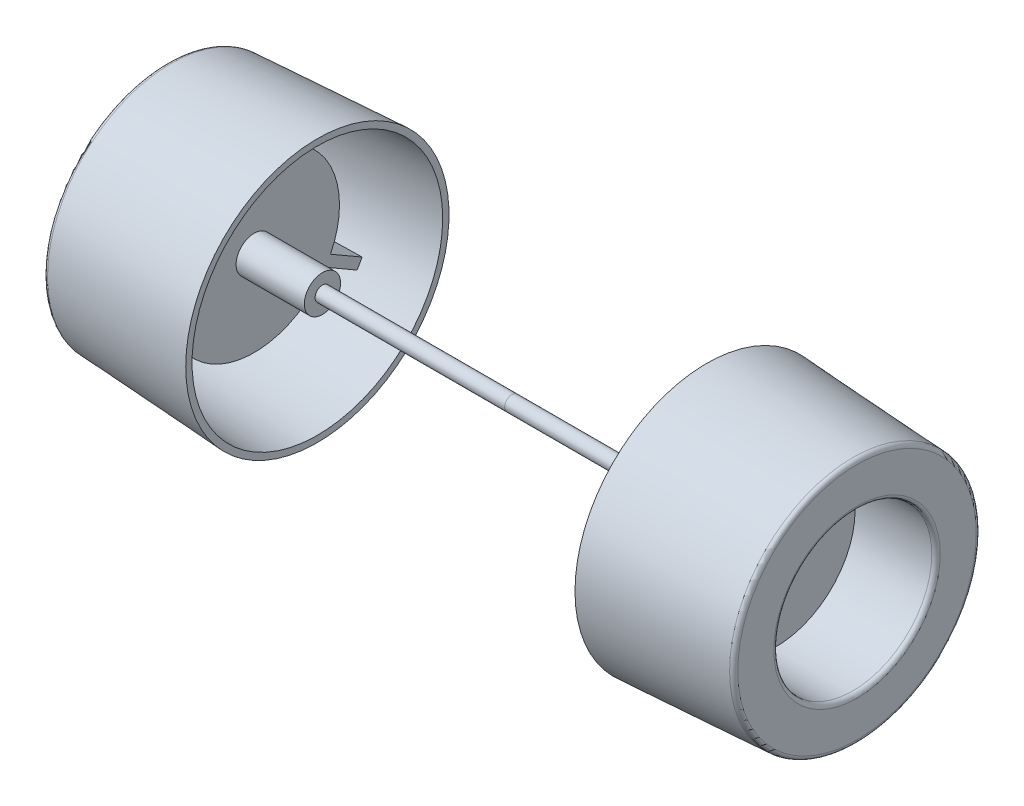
ISO-10303-21;
HEADER;
FILE_DESCRIPTION(('STEP AP214'),'2;1');
FILE_NAME('part.step','',(''),(''),'','','');
FILE_SCHEMA(('AUTOMOTIVE_DESIGN { 1 0 10303 214 1 1 1 1 }'));
ENDSEC;
DATA;
#1=APPLICATION_CONTEXT('core data for automotive mechanical design processes');
#2=APPLICATION_PROTOCOL_DEFINITION('international standard','automotive_design',2000,#1);
#3=PRODUCT_CONTEXT('',#1,'mechanical');
#4=PRODUCT('Part','Part','',(#3));
#5=PRODUCT_RELATED_PRODUCT_CATEGORY('part','',(#4));
#6=PRODUCT_DEFINITION_FORMATION('','',#4);
#7=PRODUCT_DEFINITION_CONTEXT('part definition',#1,'design');
#8=PRODUCT_DEFINITION('design','',#6,#7);
#9=PRODUCT_DEFINITION_SHAPE('','',#8);
#10=(LENGTH_UNIT() NAMED_UNIT(*) SI_UNIT(.MILLI.,.METRE.));
#11=(NAMED_UNIT(*) PLANE_ANGLE_UNIT() SI_UNIT($,.RADIAN.));
#12=(NAMED_UNIT(*) SI_UNIT($,.STERADIAN.) SOLID_ANGLE_UNIT());
#13=UNCERTAINTY_MEASURE_WITH_UNIT(LENGTH_MEASURE(1.E-05),#10,'distance_accuracy_value','');
#14=(GEOMETRIC_REPRESENTATION_CONTEXT(3) GLOBAL_UNCERTAINTY_ASSIGNED_CONTEXT((#13)) GLOBAL_UNIT_ASSIGNED_CONTEXT((#10,
#11,#12)) REPRESENTATION_CONTEXT('',''));
#15=CARTESIAN_POINT('',(0.,0.,0.));
#16=DIRECTION('',(0.,0.,1.));
#17=DIRECTION('',(1.,0.,0.));
#18=AXIS2_PLACEMENT_3D('',#15,#16,#17);
#19=CARTESIAN_POINT('',(-143.1,0.,0.));
#20=DIRECTION('',(-1.,0.,0.));
#21=DIRECTION('',(0.,0.,-1.));
#22=AXIS2_PLACEMENT_3D('',#19,#20,#21);
#23=PLANE('',#22);
#24=CARTESIAN_POINT('',(-143.1,0.,0.));
#25=DIRECTION('',(1.,0.,0.));
#26=DIRECTION('',(0.,0.,-1.));
#27=AXIS2_PLACEMENT_3D('',#24,#25,#26);
#28=CIRCLE('',#27,20.25);
#29=CARTESIAN_POINT('',(-143.1,20.2142743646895,1.20233602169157));
#30=VERTEX_POINT('',#29);
#31=CARTESIAN_POINT('',(-143.1,-9.06588364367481,18.1072431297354));
#32=VERTEX_POINT('',#31);
#33=EDGE_CURVE('E150',#30,#32,#28,.T.);
#34=ORIENTED_EDGE('',*,*,#33,.T.);
#35=DIRECTION('',(0.,0.500000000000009,-0.866025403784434));
#36=VECTOR('',#35,1.);
#37=CARTESIAN_POINT('',(-143.1,-9.06588364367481,18.1072431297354));
#38=LINE('',#37,#36);
#39=CARTESIAN_POINT('',(-143.1,-13.3998948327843,25.6139707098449));
#40=VERTEX_POINT('',#39);
#41=EDGE_CURVE('E399',#40,#32,#38,.T.);
#42=ORIENTED_EDGE('',*,*,#41,.F.);
#43=CARTESIAN_POINT('',(-143.1,0.,0.));
#44=DIRECTION('',(-1.,0.,0.));
#45=DIRECTION('',(0.,0.,1.));
#46=AXIS2_PLACEMENT_3D('',#43,#44,#45);
#47=CIRCLE('',#46,28.9073118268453);
#48=CARTESIAN_POINT('',(-143.1,-15.482401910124,24.4116346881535));
#49=VERTEX_POINT('',#48);
#50=EDGE_CURVE('E226',#40,#49,#47,.F.);
#51=ORIENTED_EDGE('',*,*,#50,.T.);
#52=DIRECTION('',(0.,-0.499999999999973,0.866025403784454));
#53=VECTOR('',#52,1.);
#54=CARTESIAN_POINT('',(-143.1,-11.1483907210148,16.9049071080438));
#55=LINE('',#54,#53);
#56=CARTESIAN_POINT('',(-143.1,-11.1483907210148,16.9049071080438));
#57=VERTEX_POINT('',#56);
#58=EDGE_CURVE('E311',#57,#49,#55,.T.);
#59=ORIENTED_EDGE('',*,*,#58,.F.);
#60=CARTESIAN_POINT('',(-143.1,-11.1483907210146,-16.904907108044));
#61=VERTEX_POINT('',#60);
#62=EDGE_CURVE('E147',#57,#61,#28,.T.);
#63=ORIENTED_EDGE('',*,*,#62,.T.);
#64=DIRECTION('',(0.,0.500000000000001,0.866025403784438));
#65=VECTOR('',#64,1.);
#66=CARTESIAN_POINT('',(-143.1,-11.1483907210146,-16.904907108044));
#67=LINE('',#66,#65);
#68=CARTESIAN_POINT('',(-143.1,-15.482401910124,-24.4116346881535));
#69=VERTEX_POINT('',#68);
#70=EDGE_CURVE('E155',#69,#61,#67,.T.);
#71=ORIENTED_EDGE('',*,*,#70,.F.);
#72=CARTESIAN_POINT('',(-143.1,0.,0.));
#73=DIRECTION('',(-1.,0.,0.));
#74=DIRECTION('',(0.,0.,1.));
#75=AXIS2_PLACEMENT_3D('',#72,#73,#74);
#76=CIRCLE('',#75,28.9073118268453);
#77=CARTESIAN_POINT('',(-143.1,-13.3998948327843,-25.6139707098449));
#78=VERTEX_POINT('',#77);
#79=EDGE_CURVE('E154',#69,#78,#76,.F.);
#80=ORIENTED_EDGE('',*,*,#79,.T.);
#81=DIRECTION('',(0.,-0.500000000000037,-0.866025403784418));
#82=VECTOR('',#81,1.);
#83=CARTESIAN_POINT('',(-143.1,-9.06588364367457,-18.1072431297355));
#84=LINE('',#83,#82);
#85=CARTESIAN_POINT('',(-143.1,-9.06588364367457,-18.1072431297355));
#86=VERTEX_POINT('',#85);
#87=EDGE_CURVE('E130',#86,#78,#84,.T.);
#88=ORIENTED_EDGE('',*,*,#87,.F.);
#89=CARTESIAN_POINT('',(-143.1,20.2142743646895,-1.20233602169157));
#90=VERTEX_POINT('',#89);
#91=EDGE_CURVE('E138',#86,#90,#28,.T.);
#92=ORIENTED_EDGE('',*,*,#91,.T.);
#93=DIRECTION('',(0.,-1.,0.));
#94=VECTOR('',#93,1.);
#95=CARTESIAN_POINT('',(-143.1,20.2142743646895,-1.20233602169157));
#96=LINE('',#95,#94);
#97=CARTESIAN_POINT('',(-143.1,28.8822967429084,-1.20233602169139));
#98=VERTEX_POINT('',#97);
#99=EDGE_CURVE('E389',#98,#90,#96,.T.);
#100=ORIENTED_EDGE('',*,*,#99,.F.);
#101=CARTESIAN_POINT('',(-143.1,0.,0.));
#102=DIRECTION('',(-1.,0.,0.));
#103=DIRECTION('',(0.,0.,1.));
#104=AXIS2_PLACEMENT_3D('',#101,#102,#103);
#105=CIRCLE('',#104,28.9073118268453);
#106=CARTESIAN_POINT('',(-143.1,28.8822967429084,1.20233602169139));
#107=VERTEX_POINT('',#106);
#108=EDGE_CURVE('E375',#98,#107,#105,.F.);
#109=ORIENTED_EDGE('',*,*,#108,.T.);
#110=DIRECTION('',(0.,1.,0.));
#111=VECTOR('',#110,1.);
#112=CARTESIAN_POINT('',(-143.1,20.2142743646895,1.20233602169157));
#113=LINE('',#112,#111);
#114=EDGE_CURVE('E391',#30,#107,#113,.T.);
#115=ORIENTED_EDGE('',*,*,#114,.F.);
#116=EDGE_LOOP('',(#34,#42,#51,#59,#63,#71,#80,#88,#92,#100,#109,#115));
#117=FACE_BOUND('',#116,.T.);
#118=CARTESIAN_POINT('',(-143.1,0.,0.));
#119=DIRECTION('',(1.,0.,0.));
#120=DIRECTION('',(0.,0.,-1.));
#121=AXIS2_PLACEMENT_3D('',#118,#119,#120);
#122=CIRCLE('',#121,4.3);
#123=CARTESIAN_POINT('',(-143.1,0.,-4.3));
#124=VERTEX_POINT('',#123);
#125=EDGE_CURVE('E421',#124,#124,#122,.F.);
#126=ORIENTED_EDGE('',*,*,#125,.T.);
#127=EDGE_LOOP('',(#126));
#128=FACE_BOUND('',#127,.T.);
#129=ADVANCED_FACE('F37',(#117,#128),#23,.F.);
#130=CARTESIAN_POINT('',(-163.716097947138,0.,0.));
#131=DIRECTION('',(1.,0.,0.));
#132=DIRECTION('',(0.,0.,1.));
#133=AXIS2_PLACEMENT_3D('',#130,#131,#132);
#134=CONICAL_SURFACE('',#133,27.7523483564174,0.0559639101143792);
#135=CARTESIAN_POINT('',(-151.1,0.,0.));
#136=DIRECTION('',(-1.,0.,0.));
#137=DIRECTION('',(0.,0.,1.));
#138=AXIS2_PLACEMENT_3D('',#135,#136,#137);
#139=CIRCLE('',#138,28.4591325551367);
#140=CARTESIAN_POINT('',(-151.1,-13.1756080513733,25.225494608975));
#141=VERTEX_POINT('',#140);
#142=CARTESIAN_POINT('',(-151.1,-15.2581151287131,24.0231585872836));
#143=VERTEX_POINT('',#142);
#144=EDGE_CURVE('E392',#141,#143,#139,.F.);
#145=ORIENTED_EDGE('',*,*,#144,.T.);
#146=CARTESIAN_POINT('',(-143.0998,-15.4824075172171,24.4116443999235));
#147=CARTESIAN_POINT('',(-144.433200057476,-15.4450250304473,24.346896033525));
#148=CARTESIAN_POINT('',(-145.766600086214,-15.4076422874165,24.2821472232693));
#149=CARTESIAN_POINT('',(-148.433400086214,-15.3328762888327,24.1526487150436));
#150=CARTESIAN_POINT('',(-149.766800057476,-15.2954930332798,24.0878990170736));
#151=CARTESIAN_POINT('',(-151.1002,-15.2581095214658,24.0231488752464));
#152=B_SPLINE_CURVE_WITH_KNOTS('',3,(#146,#147,#148,#149,#150,#151),.UNSPECIFIED.,.F.,.F.,(4,2,
4),(0.,4.00648344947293,8.01296689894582),.UNSPECIFIED.);
#153=EDGE_CURVE('E213',#49,#143,#152,.T.);
#154=ORIENTED_EDGE('',*,*,#153,.F.);
#155=ORIENTED_EDGE('',*,*,#50,.F.);
#156=CARTESIAN_POINT('',(-151.1002,-13.1756024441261,25.2254848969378));
#157=CARTESIAN_POINT('',(-149.766800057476,-13.2129859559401,25.290235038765));
#158=CARTESIAN_POINT('',(-148.433400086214,-13.250369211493,25.354984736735));
#159=CARTESIAN_POINT('',(-145.766600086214,-13.3251352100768,25.4844832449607));
#160=CARTESIAN_POINT('',(-144.433200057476,-13.3625179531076,25.5492320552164));
#161=CARTESIAN_POINT('',(-143.0998,-13.3999004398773,25.6139804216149));
#162=B_SPLINE_CURVE_WITH_KNOTS('',3,(#156,#157,#158,#159,#160,#161),.UNSPECIFIED.,.F.,.F.,(4,2,
4),(0.,4.0064834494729,8.01296689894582),.UNSPECIFIED.);
#163=EDGE_CURVE('E220',#141,#40,#162,.T.);
#164=ORIENTED_EDGE('',*,*,#163,.F.);
#165=EDGE_LOOP('',(#145,#154,#155,#164));
#166=FACE_BOUND('',#165,.T.);
#167=CARTESIAN_POINT('',(-162.3,0.,0.));
#168=DIRECTION('',(1.,0.,0.));
#169=DIRECTION('',(0.,0.,-1.));
#170=AXIS2_PLACEMENT_3D('',#167,#168,#169);
#171=CIRCLE('',#170,27.8316815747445);
#172=CARTESIAN_POINT('',(-162.3,0.,-27.8316815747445));
#173=VERTEX_POINT('',#172);
#174=EDGE_CURVE('E313',#173,#173,#171,.T.);
#175=ORIENTED_EDGE('',*,*,#174,.F.);
#176=EDGE_LOOP('',(#175));
#177=FACE_BOUND('',#176,.T.);
#178=CARTESIAN_POINT('',(-128.1,0.,0.));
#179=DIRECTION('',(1.,0.,0.));
#180=DIRECTION('',(0.,0.,-1.));
#181=AXIS2_PLACEMENT_3D('',#178,#179,#180);
#182=CIRCLE('',#181,29.7476479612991);
#183=CARTESIAN_POINT('',(-128.1,0.,-29.7476479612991));
#184=VERTEX_POINT('',#183);
#185=EDGE_CURVE('E317',#184,#184,#182,.T.);
#186=ORIENTED_EDGE('',*,*,#185,.T.);
#187=EDGE_LOOP('',(#186));
#188=FACE_BOUND('',#187,.T.);
#189=CARTESIAN_POINT('',(-151.1,0.,0.));
#190=DIRECTION('',(-1.,0.,0.));
#191=DIRECTION('',(0.,0.,1.));
#192=AXIS2_PLACEMENT_3D('',#189,#190,#191);
#193=CIRCLE('',#192,28.4591325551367);
#194=CARTESIAN_POINT('',(-151.1,28.4337231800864,-1.2023360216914));
#195=VERTEX_POINT('',#194);
#196=CARTESIAN_POINT('',(-151.1,28.4337231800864,1.2023360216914));
#197=VERTEX_POINT('',#196);
#198=EDGE_CURVE('E372',#195,#197,#193,.F.);
#199=ORIENTED_EDGE('',*,*,#198,.T.);
#200=CARTESIAN_POINT('',(-120.988941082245,30.1220402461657,1.20233602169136));
#201=CARTESIAN_POINT('',(-128.698059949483,29.6898143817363,1.20233602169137));
#202=CARTESIAN_POINT('',(-136.407177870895,29.2575716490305,1.20233602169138));
#203=CARTESIAN_POINT('',(-151.825411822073,28.393052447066,1.2023360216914));
#204=CARTESIAN_POINT('',(-159.534527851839,27.9607759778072,1.20233602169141));
#205=CARTESIAN_POINT('',(-167.24364293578,27.5284826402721,1.20233602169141));
#206=B_SPLINE_CURVE_WITH_KNOTS('',3,(#200,#201,#202,#203,#204,#205),.UNSPECIFIED.,.F.,.F.,(4,2,
4),(0.,23.1636783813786,46.3273567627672),.UNSPECIFIED.);
#207=EDGE_CURVE('E197',#107,#197,#206,.T.);
#208=ORIENTED_EDGE('',*,*,#207,.F.);
#209=ORIENTED_EDGE('',*,*,#108,.F.);
#210=CARTESIAN_POINT('',(-167.24364293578,27.5284826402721,-1.20233602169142));
#211=CARTESIAN_POINT('',(-159.534527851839,27.9607759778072,-1.20233602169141));
#212=CARTESIAN_POINT('',(-151.825411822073,28.393052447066,-1.2023360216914));
#213=CARTESIAN_POINT('',(-136.407177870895,29.2575716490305,-1.20233602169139));
#214=CARTESIAN_POINT('',(-128.698059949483,29.6898143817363,-1.20233602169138));
#215=CARTESIAN_POINT('',(-120.988941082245,30.1220402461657,-1.20233602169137));
#216=B_SPLINE_CURVE_WITH_KNOTS('',3,(#210,#211,#212,#213,#214,#215),.UNSPECIFIED.,.F.,.F.,(4,2,
4),(0.,23.1636783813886,46.3273567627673),.UNSPECIFIED.);
#217=EDGE_CURVE('E205',#195,#98,#216,.T.);
#218=ORIENTED_EDGE('',*,*,#217,.F.);
#219=EDGE_LOOP('',(#199,#208,#209,#218));
#220=FACE_BOUND('',#219,.T.);
#221=CARTESIAN_POINT('',(-151.1,0.,0.));
#222=DIRECTION('',(-1.,0.,0.));
#223=DIRECTION('',(0.,0.,1.));
#224=AXIS2_PLACEMENT_3D('',#221,#222,#223);
#225=CIRCLE('',#224,28.4591325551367);
#226=CARTESIAN_POINT('',(-151.1,-15.2581151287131,-24.0231585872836));
#227=VERTEX_POINT('',#226);
#228=CARTESIAN_POINT('',(-151.1,-13.1756080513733,-25.225494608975));
#229=VERTEX_POINT('',#228);
#230=EDGE_CURVE('E306',#227,#229,#225,.F.);
#231=ORIENTED_EDGE('',*,*,#230,.T.);
#232=CARTESIAN_POINT('',(-143.0998,-13.3999004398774,-25.6139804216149));
#233=CARTESIAN_POINT('',(-144.433200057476,-13.3625179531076,-25.5492320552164));
#234=CARTESIAN_POINT('',(-145.766600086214,-13.3251352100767,-25.4844832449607));
#235=CARTESIAN_POINT('',(-148.433400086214,-13.250369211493,-25.354984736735));
#236=CARTESIAN_POINT('',(-149.766800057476,-13.21298595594,-25.290235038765));
#237=CARTESIAN_POINT('',(-151.1002,-13.1756024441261,-25.2254848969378));
#238=B_SPLINE_CURVE_WITH_KNOTS('',3,(#232,#233,#234,#235,#236,#237),.UNSPECIFIED.,.F.,.F.,(4,2,
4),(0.,4.00648344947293,8.01296689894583),.UNSPECIFIED.);
#239=EDGE_CURVE('E53',#78,#229,#238,.T.);
#240=ORIENTED_EDGE('',*,*,#239,.F.);
#241=ORIENTED_EDGE('',*,*,#79,.F.);
#242=CARTESIAN_POINT('',(-151.1002,-15.2581095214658,-24.0231488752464));
#243=CARTESIAN_POINT('',(-149.766800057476,-15.2954930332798,-24.0878990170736));
#244=CARTESIAN_POINT('',(-148.433400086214,-15.3328762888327,-24.1526487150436));
#245=CARTESIAN_POINT('',(-145.766600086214,-15.4076422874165,-24.2821472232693));
#246=CARTESIAN_POINT('',(-144.433200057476,-15.4450250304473,-24.346896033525));
#247=CARTESIAN_POINT('',(-143.0998,-15.4824075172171,-24.4116443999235));
#248=B_SPLINE_CURVE_WITH_KNOTS('',3,(#242,#243,#244,#245,#246,#247),.UNSPECIFIED.,.F.,.F.,(4,2,
4),(0.,4.0064834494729,8.01296689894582),.UNSPECIFIED.);
#249=EDGE_CURVE('E176',#227,#69,#248,.T.);
#250=ORIENTED_EDGE('',*,*,#249,.F.);
#251=EDGE_LOOP('',(#231,#240,#241,#250));
#252=FACE_BOUND('',#251,.T.);
#253=ADVANCED_FACE('F184',(#166,#177,#188,#220,#252),#134,.F.);
#254=CARTESIAN_POINT('',(-163.8,0.,0.));
#255=DIRECTION('',(-1.,0.,0.));
#256=DIRECTION('',(0.,0.,-1.));
#257=AXIS2_PLACEMENT_3D('',#254,#255,#256);
#258=PLANE('',#257);
#259=CARTESIAN_POINT('',(-163.8,0.,0.));
#260=DIRECTION('',(1.,0.,0.));
#261=DIRECTION('',(0.,0.,-1.));
#262=AXIS2_PLACEMENT_3D('',#259,#260,#261);
#263=CIRCLE('',#262,19.75);
#264=CARTESIAN_POINT('',(-163.8,0.,-19.75));
#265=VERTEX_POINT('',#264);
#266=EDGE_CURVE('E46',#265,#265,#263,.F.);
#267=ORIENTED_EDGE('',*,*,#266,.F.);
#268=EDGE_LOOP('',(#267));
#269=FACE_BOUND('',#268,.T.);
#270=CARTESIAN_POINT('',(-163.8,0.,0.));
#271=DIRECTION('',(1.,0.,0.));
#272=DIRECTION('',(0.,0.,-1.));
#273=AXIS2_PLACEMENT_3D('',#270,#271,#272);
#274=CIRCLE('',#273,28.304454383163);
#275=CARTESIAN_POINT('',(-163.8,0.,-28.304454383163));
#276=VERTEX_POINT('',#275);
#277=EDGE_CURVE('E433',#276,#276,#274,.T.);
#278=ORIENTED_EDGE('',*,*,#277,.F.);
#279=EDGE_LOOP('',(#278));
#280=FACE_BOUND('',#279,.T.);
#281=ADVANCED_FACE('F189',(#269,#280),#258,.T.);
#282=CARTESIAN_POINT('',(-128.1,0.,0.));
#283=DIRECTION('',(-1.,0.,0.));
#284=DIRECTION('',(0.,0.,-1.));
#285=AXIS2_PLACEMENT_3D('',#282,#283,#284);
#286=PLANE('',#285);
#287=ORIENTED_EDGE('',*,*,#185,.F.);
#288=EDGE_LOOP('',(#287));
#289=FACE_BOUND('',#288,.T.);
#290=CARTESIAN_POINT('',(-128.1,0.,0.));
#291=DIRECTION('',(1.,0.,0.));
#292=DIRECTION('',(0.,0.,-1.));
#293=AXIS2_PLACEMENT_3D('',#290,#291,#292);
#294=CIRCLE('',#293,31.25);
#295=CARTESIAN_POINT('',(-128.1,0.,31.25));
#296=VERTEX_POINT('',#295);
#297=EDGE_CURVE('E323',#296,#296,#294,.T.);
#298=ORIENTED_EDGE('',*,*,#297,.T.);
#299=EDGE_LOOP('',(#298));
#300=FACE_BOUND('',#299,.T.);
#301=ADVANCED_FACE('F39',(#289,#300),#286,.F.);
#302=CARTESIAN_POINT('',(-163.8,0.,0.));
#303=DIRECTION('',(1.,0.,0.));
#304=DIRECTION('',(0.,0.,1.));
#305=AXIS2_PLACEMENT_3D('',#302,#303,#304);
#306=CONICAL_SURFACE('',#305,29.25,0.0559639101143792);
#307=CARTESIAN_POINT('',(-162.855934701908,0.,0.));
#308=DIRECTION('',(1.,0.,0.));
#309=DIRECTION('',(0.,0.,-1.));
#310=AXIS2_PLACEMENT_3D('',#307,#308,#309);
#311=CIRCLE('',#310,29.3028888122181);
#312=CARTESIAN_POINT('',(-162.855934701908,0.,29.3028888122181));
#313=VERTEX_POINT('',#312);
#314=EDGE_CURVE('E13',#313,#313,#311,.F.);
#315=CARTESIAN_POINT('',(-162.855934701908,0.,29.3028888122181));
#316=CARTESIAN_POINT('',(-162.49389371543,0.,29.3231712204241));
#317=CARTESIAN_POINT('',(-162.131852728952,0.,29.3434536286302));
#318=CARTESIAN_POINT('',(-161.407770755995,0.,29.3840184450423));
#319=CARTESIAN_POINT('',(-161.045729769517,0.,29.4043008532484));
#320=CARTESIAN_POINT('',(-160.32164779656,0.,29.4448656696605));
#321=CARTESIAN_POINT('',(-159.959606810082,0.,29.4651480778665));
#322=CARTESIAN_POINT('',(-159.235524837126,0.,29.5057128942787));
#323=CARTESIAN_POINT('',(-158.873483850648,0.,29.5259953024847));
#324=CARTESIAN_POINT('',(-158.149401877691,0.,29.5665601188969));
#325=CARTESIAN_POINT('',(-157.787360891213,0.,29.5868425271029));
#326=CARTESIAN_POINT('',(-157.063278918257,0.,29.627407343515));
#327=CARTESIAN_POINT('',(-156.701237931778,0.,29.6476897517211));
#328=CARTESIAN_POINT('',(-155.977155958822,0.,29.6882545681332));
#329=CARTESIAN_POINT('',(-155.615114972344,0.,29.7085369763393));
#330=CARTESIAN_POINT('',(-154.891032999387,0.,29.7491017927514));
#331=CARTESIAN_POINT('',(-154.528992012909,0.,29.7693842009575));
#332=CARTESIAN_POINT('',(-153.804910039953,0.,29.8099490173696));
#333=CARTESIAN_POINT('',(-153.442869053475,0.,29.8302314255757));
#334=CARTESIAN_POINT('',(-152.718787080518,0.,29.8707962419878));
#335=CARTESIAN_POINT('',(-152.35674609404,0.,29.8910786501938));
#336=CARTESIAN_POINT('',(-151.632664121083,0.,29.931643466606));
#337=CARTESIAN_POINT('',(-151.270623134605,0.,29.951925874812));
#338=CARTESIAN_POINT('',(-150.546541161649,0.,29.9924906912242));
#339=CARTESIAN_POINT('',(-150.184500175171,0.,30.0127730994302));
#340=CARTESIAN_POINT('',(-149.460418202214,0.,30.0533379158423));
#341=CARTESIAN_POINT('',(-149.098377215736,0.,30.0736203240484));
#342=CARTESIAN_POINT('',(-148.37429524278,0.,30.1141851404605));
#343=CARTESIAN_POINT('',(-148.012254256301,0.,30.1344675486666));
#344=CARTESIAN_POINT('',(-147.288172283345,0.,30.1750323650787));
#345=CARTESIAN_POINT('',(-146.926131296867,0.,30.1953147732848));
#346=CARTESIAN_POINT('',(-146.20204932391,0.,30.2358795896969));
#347=CARTESIAN_POINT('',(-145.840008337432,0.,30.256161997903));
#348=CARTESIAN_POINT('',(-145.115926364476,0.,30.2967268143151));
#349=CARTESIAN_POINT('',(-144.753885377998,0.,30.3170092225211));
#350=CARTESIAN_POINT('',(-144.029803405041,0.,30.3575740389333));
#351=CARTESIAN_POINT('',(-143.667762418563,0.,30.3778564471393));
#352=CARTESIAN_POINT('',(-142.943680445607,0.,30.4184212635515));
#353=CARTESIAN_POINT('',(-142.581639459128,0.,30.4387036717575));
#354=CARTESIAN_POINT('',(-141.857557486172,0.,30.4792684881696));
#355=CARTESIAN_POINT('',(-141.495516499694,0.,30.4995508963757));
#356=CARTESIAN_POINT('',(-140.771434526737,0.,30.5401157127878));
#357=CARTESIAN_POINT('',(-140.409393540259,0.,30.5603981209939));
#358=CARTESIAN_POINT('',(-139.685311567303,0.,30.600962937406));
#359=CARTESIAN_POINT('',(-139.323270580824,0.,30.6212453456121));
#360=CARTESIAN_POINT('',(-138.599188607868,0.,30.6618101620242));
#361=CARTESIAN_POINT('',(-138.23714762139,0.,30.6820925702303));
#362=CARTESIAN_POINT('',(-137.513065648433,0.,30.7226573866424));
#363=CARTESIAN_POINT('',(-137.151024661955,0.,30.7429397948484));
#364=CARTESIAN_POINT('',(-136.426942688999,0.,30.7835046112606));
#365=CARTESIAN_POINT('',(-136.064901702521,0.,30.8037870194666));
#366=CARTESIAN_POINT('',(-135.340819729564,0.,30.8443518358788));
#367=CARTESIAN_POINT('',(-134.978778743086,0.,30.8646342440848));
#368=CARTESIAN_POINT('',(-134.25469677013,0.,30.9051990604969));
#369=CARTESIAN_POINT('',(-133.892655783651,0.,30.925481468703));
#370=CARTESIAN_POINT('',(-133.168573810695,0.,30.9660462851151));
#371=CARTESIAN_POINT('',(-132.806532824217,0.,30.9863286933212));
#372=CARTESIAN_POINT('',(-132.08245085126,0.,31.0268935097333));
#373=CARTESIAN_POINT('',(-131.720409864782,0.,31.0471759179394));
#374=CARTESIAN_POINT('',(-130.996327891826,0.,31.0877407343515));
#375=CARTESIAN_POINT('',(-130.634286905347,0.,31.1080231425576));
#376=CARTESIAN_POINT('',(-129.910204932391,0.,31.1485879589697));
#377=CARTESIAN_POINT('',(-129.548163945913,0.,31.1688703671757));
#378=CARTESIAN_POINT('',(-128.824081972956,0.,31.2094351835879));
#379=CARTESIAN_POINT('',(-128.462040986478,0.,31.2297175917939));
#380=CARTESIAN_POINT('',(-128.1,0.,31.25));
#381=B_SPLINE_CURVE_WITH_KNOTS('',3,(#315,#316,#317,#318,#319,#320,#321,#322,#323,#324,#325,
#326,#327,#328,#329,#330,#331,#332,#333,#334,#335,#336,#337,#338,#339,#340,#341,#342,#343,#344,
#345,#346,#347,#348,#349,#350,#351,#352,#353,#354,#355,#356,#357,#358,#359,#360,#361,#362,#363,
#364,#365,#366,#367,#368,#369,#370,#371,#372,#373,#374,#375,#376,#377,#378,#379,#380),
.UNSPECIFIED.,.F.,.F.,(4,2,2,2,2,2,2,2,2,2,2,2,2,2,2,2,2,2,2,2,2,2,2,2,2,2,2,2,2,2,2,2,4),(0.,
1.08782602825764,2.17565205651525,3.26347808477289,4.35130411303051,5.43913014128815,
6.52695616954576,7.61478219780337,8.70260822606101,9.79043425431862,10.8782602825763,
11.9660863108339,13.0539123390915,14.1417383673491,15.2295643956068,16.3173904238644,
17.405216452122,18.4930424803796,19.5808685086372,20.6686945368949,21.7565205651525,
22.8443465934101,23.9321726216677,25.0199986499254,26.107824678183,27.1956507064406,
28.2834767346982,29.3713027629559,30.4591287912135,31.5469548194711,32.6347808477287,
33.7226068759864,34.810432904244),.UNSPECIFIED.);
#382=EDGE_CURVE('BSEAM332',#313,#296,#381,.T.);
#383=ORIENTED_EDGE('',*,*,#314,.F.);
#384=ORIENTED_EDGE('',*,*,#297,.F.);
#385=ORIENTED_EDGE('',*,*,#382,.T.);
#386=ORIENTED_EDGE('',*,*,#382,.F.);
#387=EDGE_LOOP('',(#383,#385,#384,#386));
#388=FACE_BOUND('',#387,.T.);
#389=ADVANCED_FACE('F332',(#388),#306,.T.);
#390=CARTESIAN_POINT('',(-144.6,0.,0.));
#391=DIRECTION('',(-1.,0.,0.));
#392=DIRECTION('',(0.,0.,-1.));
#393=AXIS2_PLACEMENT_3D('',#390,#391,#392);
#394=CYLINDRICAL_SURFACE('',#393,18.75);
#395=CARTESIAN_POINT('',(-162.8,0.,0.));
#396=DIRECTION('',(1.,0.,0.));
#397=DIRECTION('',(0.,0.,-1.));
#398=AXIS2_PLACEMENT_3D('',#395,#396,#397);
#399=CIRCLE('',#398,18.75);
#400=CARTESIAN_POINT('',(-162.8,0.,-18.75));
#401=VERTEX_POINT('',#400);
#402=EDGE_CURVE('E424',#401,#401,#399,.T.);
#403=ORIENTED_EDGE('',*,*,#402,.F.);
#404=EDGE_LOOP('',(#403));
#405=FACE_BOUND('',#404,.T.);
#406=CARTESIAN_POINT('',(-144.6,0.,0.));
#407=DIRECTION('',(1.,0.,0.));
#408=DIRECTION('',(0.,0.,-1.));
#409=AXIS2_PLACEMENT_3D('',#406,#407,#408);
#410=CIRCLE('',#409,18.75);
#411=CARTESIAN_POINT('',(-144.6,0.,-18.75));
#412=VERTEX_POINT('',#411);
#413=EDGE_CURVE('E320',#412,#412,#410,.T.);
#414=ORIENTED_EDGE('',*,*,#413,.T.);
#415=EDGE_LOOP('',(#414));
#416=FACE_BOUND('',#415,.T.);
#417=ADVANCED_FACE('F341',(#405,#416),#394,.F.);
#418=CARTESIAN_POINT('',(-144.6,0.,0.));
#419=DIRECTION('',(-1.,0.,0.));
#420=DIRECTION('',(0.,0.,-1.));
#421=AXIS2_PLACEMENT_3D('',#418,#419,#420);
#422=PLANE('',#421);
#423=ORIENTED_EDGE('',*,*,#413,.F.);
#424=EDGE_LOOP('',(#423));
#425=FACE_BOUND('',#424,.T.);
#426=ADVANCED_FACE('F347',(#425),#422,.T.);
#427=CARTESIAN_POINT('',(-162.3,0.,0.));
#428=DIRECTION('',(-1.,0.,0.));
#429=DIRECTION('',(0.,0.,-1.));
#430=AXIS2_PLACEMENT_3D('',#427,#428,#429);
#431=PLANE('',#430);
#432=CARTESIAN_POINT('',(-162.3,0.,0.));
#433=DIRECTION('',(1.,0.,0.));
#434=DIRECTION('',(0.,0.,-1.));
#435=AXIS2_PLACEMENT_3D('',#432,#433,#434);
#436=CIRCLE('',#435,20.25);
#437=CARTESIAN_POINT('',(-162.3,0.,-20.25));
#438=VERTEX_POINT('',#437);
#439=EDGE_CURVE('E148',#438,#438,#436,.T.);
#440=ORIENTED_EDGE('',*,*,#439,.F.);
#441=EDGE_LOOP('',(#440));
#442=FACE_BOUND('',#441,.T.);
#443=ORIENTED_EDGE('',*,*,#174,.T.);
#444=EDGE_LOOP('',(#443));
#445=FACE_BOUND('',#444,.T.);
#446=ADVANCED_FACE('F191',(#442,#445),#431,.F.);
#447=CARTESIAN_POINT('',(-144.6,0.,0.));
#448=DIRECTION('',(-1.,0.,0.));
#449=DIRECTION('',(0.,0.,-1.));
#450=AXIS2_PLACEMENT_3D('',#447,#448,#449);
#451=CYLINDRICAL_SURFACE('',#450,20.25);
#452=DIRECTION('',(1.,0.,0.));
#453=VECTOR('',#452,1.);
#454=CARTESIAN_POINT('',(-151.1,-11.1483907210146,-16.904907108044));
#455=LINE('',#454,#453);
#456=CARTESIAN_POINT('',(-151.1,-11.1483907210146,-16.904907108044));
#457=VERTEX_POINT('',#456);
#458=EDGE_CURVE('E134',#457,#61,#455,.T.);
#459=ORIENTED_EDGE('',*,*,#458,.T.);
#460=ORIENTED_EDGE('',*,*,#62,.F.);
#461=DIRECTION('',(1.,0.,0.));
#462=VECTOR('',#461,1.);
#463=CARTESIAN_POINT('',(-151.1,-11.1483907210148,16.9049071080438));
#464=LINE('',#463,#462);
#465=CARTESIAN_POINT('',(-151.1,-11.1483907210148,16.9049071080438));
#466=VERTEX_POINT('',#465);
#467=EDGE_CURVE('E402',#466,#57,#464,.T.);
#468=ORIENTED_EDGE('',*,*,#467,.F.);
#469=CARTESIAN_POINT('',(-151.1,0.,0.));
#470=DIRECTION('',(1.,0.,0.));
#471=DIRECTION('',(0.,0.,1.));
#472=AXIS2_PLACEMENT_3D('',#469,#470,#471);
#473=CIRCLE('',#472,20.25);
#474=CARTESIAN_POINT('',(-151.1,-9.06588364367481,18.1072431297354));
#475=VERTEX_POINT('',#474);
#476=EDGE_CURVE('E404',#475,#466,#473,.T.);
#477=ORIENTED_EDGE('',*,*,#476,.F.);
#478=DIRECTION('',(1.,0.,0.));
#479=VECTOR('',#478,1.);
#480=CARTESIAN_POINT('',(-151.1,-9.06588364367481,18.1072431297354));
#481=LINE('',#480,#479);
#482=EDGE_CURVE('E401',#475,#32,#481,.T.);
#483=ORIENTED_EDGE('',*,*,#482,.T.);
#484=ORIENTED_EDGE('',*,*,#33,.F.);
#485=DIRECTION('',(1.,0.,0.));
#486=VECTOR('',#485,1.);
#487=CARTESIAN_POINT('',(-151.1,20.2142743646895,1.20233602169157));
#488=LINE('',#487,#486);
#489=CARTESIAN_POINT('',(-151.1,20.2142743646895,1.20233602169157));
#490=VERTEX_POINT('',#489);
#491=EDGE_CURVE('E379',#490,#30,#488,.T.);
#492=ORIENTED_EDGE('',*,*,#491,.F.);
#493=CARTESIAN_POINT('',(-151.1,0.,0.));
#494=DIRECTION('',(1.,0.,0.));
#495=DIRECTION('',(0.,0.,1.));
#496=AXIS2_PLACEMENT_3D('',#493,#494,#495);
#497=CIRCLE('',#496,20.25);
#498=CARTESIAN_POINT('',(-151.1,20.2142743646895,-1.20233602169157));
#499=VERTEX_POINT('',#498);
#500=EDGE_CURVE('E386',#499,#490,#497,.T.);
#501=ORIENTED_EDGE('',*,*,#500,.F.);
#502=DIRECTION('',(1.,0.,0.));
#503=VECTOR('',#502,1.);
#504=CARTESIAN_POINT('',(-151.1,20.2142743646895,-1.20233602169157));
#505=LINE('',#504,#503);
#506=EDGE_CURVE('E143',#499,#90,#505,.T.);
#507=ORIENTED_EDGE('',*,*,#506,.T.);
#508=ORIENTED_EDGE('',*,*,#91,.F.);
#509=DIRECTION('',(1.,0.,0.));
#510=VECTOR('',#509,1.);
#511=CARTESIAN_POINT('',(-151.1,-9.06588364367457,-18.1072431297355));
#512=LINE('',#511,#510);
#513=CARTESIAN_POINT('',(-151.1,-9.06588364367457,-18.1072431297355));
#514=VERTEX_POINT('',#513);
#515=EDGE_CURVE('E126',#514,#86,#512,.T.);
#516=ORIENTED_EDGE('',*,*,#515,.F.);
#517=CARTESIAN_POINT('',(-151.1,0.,0.));
#518=DIRECTION('',(1.,0.,0.));
#519=DIRECTION('',(0.,0.,1.));
#520=AXIS2_PLACEMENT_3D('',#517,#518,#519);
#521=CIRCLE('',#520,20.25);
#522=EDGE_CURVE('E159',#457,#514,#521,.T.);
#523=ORIENTED_EDGE('',*,*,#522,.F.);
#524=EDGE_LOOP('',(#459,#460,#468,#477,#483,#484,#492,#501,#507,#508,#516,#523));
#525=FACE_BOUND('',#524,.T.);
#526=ORIENTED_EDGE('',*,*,#439,.T.);
#527=EDGE_LOOP('',(#526));
#528=FACE_BOUND('',#527,.T.);
#529=ADVANCED_FACE('F139',(#525,#528),#451,.T.);
#530=CARTESIAN_POINT('',(-151.1,0.,0.));
#531=DIRECTION('',(1.,0.,0.));
#532=DIRECTION('',(0.,0.,1.));
#533=AXIS2_PLACEMENT_3D('',#530,#531,#532);
#534=PLANE('',#533);
#535=DIRECTION('',(0.,-1.,0.));
#536=VECTOR('',#535,1.);
#537=CARTESIAN_POINT('',(-151.1,20.2142743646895,-1.20233602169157));
#538=LINE('',#537,#536);
#539=EDGE_CURVE('E381',#195,#499,#538,.T.);
#540=ORIENTED_EDGE('',*,*,#539,.T.);
#541=ORIENTED_EDGE('',*,*,#500,.T.);
#542=DIRECTION('',(0.,1.,0.));
#543=VECTOR('',#542,1.);
#544=CARTESIAN_POINT('',(-151.1,20.2142743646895,1.20233602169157));
#545=LINE('',#544,#543);
#546=EDGE_CURVE('E384',#490,#197,#545,.T.);
#547=ORIENTED_EDGE('',*,*,#546,.T.);
#548=ORIENTED_EDGE('',*,*,#198,.F.);
#549=EDGE_LOOP('',(#540,#541,#547,#548));
#550=FACE_BOUND('',#549,.T.);
#551=ADVANCED_FACE('F239',(#550),#534,.F.);
#552=CARTESIAN_POINT('',(-151.1,20.2142743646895,-1.20233602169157));
#553=DIRECTION('',(0.,0.,-1.));
#554=DIRECTION('',(0.,1.,0.));
#555=AXIS2_PLACEMENT_3D('',#552,#553,#554);
#556=PLANE('',#555);
#557=ORIENTED_EDGE('',*,*,#217,.T.);
#558=ORIENTED_EDGE('',*,*,#99,.T.);
#559=ORIENTED_EDGE('',*,*,#506,.F.);
#560=ORIENTED_EDGE('',*,*,#539,.F.);
#561=EDGE_LOOP('',(#557,#558,#559,#560));
#562=FACE_BOUND('',#561,.T.);
#563=ADVANCED_FACE('F241',(#562),#556,.T.);
#564=CARTESIAN_POINT('',(-151.1,20.2142743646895,1.20233602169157));
#565=DIRECTION('',(0.,0.,1.));
#566=DIRECTION('',(0.,-1.,0.));
#567=AXIS2_PLACEMENT_3D('',#564,#565,#566);
#568=PLANE('',#567);
#569=ORIENTED_EDGE('',*,*,#207,.T.);
#570=ORIENTED_EDGE('',*,*,#546,.F.);
#571=ORIENTED_EDGE('',*,*,#491,.T.);
#572=ORIENTED_EDGE('',*,*,#114,.T.);
#573=EDGE_LOOP('',(#569,#570,#571,#572));
#574=FACE_BOUND('',#573,.T.);
#575=ADVANCED_FACE('F245',(#574),#568,.T.);
#576=CARTESIAN_POINT('',(-151.1,0.,0.));
#577=DIRECTION('',(1.,0.,0.));
#578=DIRECTION('',(0.,0.,1.));
#579=AXIS2_PLACEMENT_3D('',#576,#577,#578);
#580=PLANE('',#579);
#581=DIRECTION('',(0.,0.500000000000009,-0.866025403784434));
#582=VECTOR('',#581,1.);
#583=CARTESIAN_POINT('',(-151.1,-9.06588364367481,18.1072431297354));
#584=LINE('',#583,#582);
#585=EDGE_CURVE('E412',#141,#475,#584,.T.);
#586=ORIENTED_EDGE('',*,*,#585,.T.);
#587=ORIENTED_EDGE('',*,*,#476,.T.);
#588=DIRECTION('',(0.,-0.499999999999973,0.866025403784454));
#589=VECTOR('',#588,1.);
#590=CARTESIAN_POINT('',(-151.1,-11.1483907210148,16.9049071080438));
#591=LINE('',#590,#589);
#592=EDGE_CURVE('E410',#466,#143,#591,.T.);
#593=ORIENTED_EDGE('',*,*,#592,.T.);
#594=ORIENTED_EDGE('',*,*,#144,.F.);
#595=EDGE_LOOP('',(#586,#587,#593,#594));
#596=FACE_BOUND('',#595,.T.);
#597=ADVANCED_FACE('F232',(#596),#580,.F.);
#598=CARTESIAN_POINT('',(-151.1,-9.06588364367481,18.1072431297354));
#599=DIRECTION('',(0.,0.866025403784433,0.500000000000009));
#600=DIRECTION('',(0.,-0.500000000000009,0.866025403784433));
#601=AXIS2_PLACEMENT_3D('',#598,#599,#600);
#602=PLANE('',#601);
#603=ORIENTED_EDGE('',*,*,#163,.T.);
#604=ORIENTED_EDGE('',*,*,#41,.T.);
#605=ORIENTED_EDGE('',*,*,#482,.F.);
#606=ORIENTED_EDGE('',*,*,#585,.F.);
#607=EDGE_LOOP('',(#603,#604,#605,#606));
#608=FACE_BOUND('',#607,.T.);
#609=ADVANCED_FACE('F228',(#608),#602,.T.);
#610=CARTESIAN_POINT('',(-151.1,-11.1483907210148,16.9049071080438));
#611=DIRECTION('',(0.,-0.866025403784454,-0.499999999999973));
#612=DIRECTION('',(0.,0.499999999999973,-0.866025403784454));
#613=AXIS2_PLACEMENT_3D('',#610,#611,#612);
#614=PLANE('',#613);
#615=ORIENTED_EDGE('',*,*,#153,.T.);
#616=ORIENTED_EDGE('',*,*,#592,.F.);
#617=ORIENTED_EDGE('',*,*,#467,.T.);
#618=ORIENTED_EDGE('',*,*,#58,.T.);
#619=EDGE_LOOP('',(#615,#616,#617,#618));
#620=FACE_BOUND('',#619,.T.);
#621=ADVANCED_FACE('F231',(#620),#614,.T.);
#622=CARTESIAN_POINT('',(-151.1,0.,0.));
#623=DIRECTION('',(1.,0.,0.));
#624=DIRECTION('',(0.,0.,1.));
#625=AXIS2_PLACEMENT_3D('',#622,#623,#624);
#626=PLANE('',#625);
#627=DIRECTION('',(0.,0.500000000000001,0.866025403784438));
#628=VECTOR('',#627,1.);
#629=CARTESIAN_POINT('',(-151.1,-11.1483907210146,-16.904907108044));
#630=LINE('',#629,#628);
#631=EDGE_CURVE('E135',#227,#457,#630,.T.);
#632=ORIENTED_EDGE('',*,*,#631,.T.);
#633=ORIENTED_EDGE('',*,*,#522,.T.);
#634=DIRECTION('',(0.,-0.500000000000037,-0.866025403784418));
#635=VECTOR('',#634,1.);
#636=CARTESIAN_POINT('',(-151.1,-9.06588364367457,-18.1072431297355));
#637=LINE('',#636,#635);
#638=EDGE_CURVE('E60',#514,#229,#637,.T.);
#639=ORIENTED_EDGE('',*,*,#638,.T.);
#640=ORIENTED_EDGE('',*,*,#230,.F.);
#641=EDGE_LOOP('',(#632,#633,#639,#640));
#642=FACE_BOUND('',#641,.T.);
#643=ADVANCED_FACE('F237',(#642),#626,.F.);
#644=CARTESIAN_POINT('',(-151.1,-11.1483907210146,-16.904907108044));
#645=DIRECTION('',(0.,-0.866025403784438,0.500000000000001));
#646=DIRECTION('',(0.,-0.500000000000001,-0.866025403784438));
#647=AXIS2_PLACEMENT_3D('',#644,#645,#646);
#648=PLANE('',#647);
#649=ORIENTED_EDGE('',*,*,#249,.T.);
#650=ORIENTED_EDGE('',*,*,#70,.T.);
#651=ORIENTED_EDGE('',*,*,#458,.F.);
#652=ORIENTED_EDGE('',*,*,#631,.F.);
#653=EDGE_LOOP('',(#649,#650,#651,#652));
#654=FACE_BOUND('',#653,.T.);
#655=ADVANCED_FACE('F292',(#654),#648,.T.);
#656=CARTESIAN_POINT('',(-151.1,-9.06588364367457,-18.1072431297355));
#657=DIRECTION('',(0.,0.866025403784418,-0.500000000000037));
#658=DIRECTION('',(0.,0.500000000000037,0.866025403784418));
#659=AXIS2_PLACEMENT_3D('',#656,#657,#658);
#660=PLANE('',#659);
#661=ORIENTED_EDGE('',*,*,#239,.T.);
#662=ORIENTED_EDGE('',*,*,#638,.F.);
#663=ORIENTED_EDGE('',*,*,#515,.T.);
#664=ORIENTED_EDGE('',*,*,#87,.T.);
#665=EDGE_LOOP('',(#661,#662,#663,#664));
#666=FACE_BOUND('',#665,.T.);
#667=ADVANCED_FACE('F128',(#666),#660,.T.);
#668=CARTESIAN_POINT('',(-126.9,0.,0.));
#669=DIRECTION('',(1.,0.,0.));
#670=DIRECTION('',(0.,0.,1.));
#671=AXIS2_PLACEMENT_3D('',#668,#669,#670);
#672=PLANE('',#671);
#673=CARTESIAN_POINT('',(-126.9,0.,0.));
#674=DIRECTION('',(-1.,0.,0.));
#675=DIRECTION('',(0.,0.,1.));
#676=AXIS2_PLACEMENT_3D('',#673,#674,#675);
#677=CIRCLE('',#676,4.3);
#678=CARTESIAN_POINT('',(-126.9,0.,4.3));
#679=VERTEX_POINT('',#678);
#680=EDGE_CURVE('E156',#679,#679,#677,.T.);
#681=ORIENTED_EDGE('',*,*,#680,.F.);
#682=EDGE_LOOP('',(#681));
#683=FACE_BOUND('',#682,.T.);
#684=CARTESIAN_POINT('',(-126.9,0.,0.));
#685=DIRECTION('',(-1.,0.,0.));
#686=DIRECTION('',(0.,0.,1.));
#687=AXIS2_PLACEMENT_3D('',#684,#685,#686);
#688=CIRCLE('',#687,1.745);
#689=CARTESIAN_POINT('',(-126.9,0.,1.745));
#690=VERTEX_POINT('',#689);
#691=EDGE_CURVE('E162',#690,#690,#688,.T.);
#692=ORIENTED_EDGE('',*,*,#691,.T.);
#693=EDGE_LOOP('',(#692));
#694=FACE_BOUND('',#693,.T.);
#695=ADVANCED_FACE('F282',(#683,#694),#672,.T.);
#696=CARTESIAN_POINT('',(-126.9,0.,0.));
#697=DIRECTION('',(-1.,0.,0.));
#698=DIRECTION('',(0.,0.,-1.));
#699=AXIS2_PLACEMENT_3D('',#696,#697,#698);
#700=CYLINDRICAL_SURFACE('',#699,4.3);
#701=ORIENTED_EDGE('',*,*,#680,.T.);
#702=EDGE_LOOP('',(#701));
#703=FACE_BOUND('',#702,.T.);
#704=ORIENTED_EDGE('',*,*,#125,.F.);
#705=EDGE_LOOP('',(#704));
#706=FACE_BOUND('',#705,.T.);
#707=ADVANCED_FACE('F271',(#703,#706),#700,.T.);
#708=CARTESIAN_POINT('',(-126.9,0.,0.));
#709=DIRECTION('',(-1.,0.,0.));
#710=DIRECTION('',(0.,0.,-1.));
#711=AXIS2_PLACEMENT_3D('',#708,#709,#710);
#712=CYLINDRICAL_SURFACE('',#711,1.745);
#713=ORIENTED_EDGE('',*,*,#691,.F.);
#714=EDGE_LOOP('',(#713));
#715=FACE_BOUND('',#714,.T.);
#716=CARTESIAN_POINT('',(-143.1,0.,0.));
#717=DIRECTION('',(-1.,0.,0.));
#718=DIRECTION('',(0.,0.,1.));
#719=AXIS2_PLACEMENT_3D('',#716,#717,#718);
#720=CIRCLE('',#719,1.745);
#721=CARTESIAN_POINT('',(-143.1,0.,1.745));
#722=VERTEX_POINT('',#721);
#723=EDGE_CURVE('E276',#722,#722,#720,.T.);
#724=ORIENTED_EDGE('',*,*,#723,.T.);
#725=EDGE_LOOP('',(#724));
#726=FACE_BOUND('',#725,.T.);
#727=ADVANCED_FACE('F262',(#715,#726),#712,.F.);
#728=ORIENTED_EDGE('',*,*,#723,.F.);
#729=EDGE_LOOP('',(#728));
#730=FACE_BOUND('',#729,.T.);
#731=ADVANCED_FACE('F256',(#730),#23,.F.);
#732=CARTESIAN_POINT('',(-162.8,0.,0.));
#733=DIRECTION('',(-1.,0.,0.));
#734=DIRECTION('',(0.,0.,-1.));
#735=AXIS2_PLACEMENT_3D('',#732,#733,#734);
#736=TOROIDAL_SURFACE('',#735,19.75,1.);
#737=ORIENTED_EDGE('',*,*,#266,.T.);
#738=EDGE_LOOP('',(#737));
#739=FACE_BOUND('',#738,.T.);
#740=ORIENTED_EDGE('',*,*,#402,.T.);
#741=EDGE_LOOP('',(#740));
#742=FACE_BOUND('',#741,.T.);
#743=ADVANCED_FACE('F261',(#739,#742),#736,.T.);
#744=CARTESIAN_POINT('',(-162.8,0.,0.));
#745=DIRECTION('',(-1.,0.,0.));
#746=DIRECTION('',(0.,0.,-1.));
#747=AXIS2_PLACEMENT_3D('',#744,#745,#746);
#748=TOROIDAL_SURFACE('',#747,28.304454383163,1.);
#749=ORIENTED_EDGE('',*,*,#314,.T.);
#750=EDGE_LOOP('',(#749));
#751=FACE_BOUND('',#750,.T.);
#752=ORIENTED_EDGE('',*,*,#277,.T.);
#753=EDGE_LOOP('',(#752));
#754=FACE_BOUND('',#753,.T.);
#755=ADVANCED_FACE('F268',(#751,#754),#748,.T.);
#756=CLOSED_SHELL('',(#129,#253,#281,#301,#389,#417,#426,#446,#529,#551,#563,#575,#597,#609,
#621,#643,#655,#667,#695,#707,#727,#731,#743,#755));
#757=MANIFOLD_SOLID_BREP('B2',#756);
#758=CARTESIAN_POINT('',(-81.9,0.,0.));
#759=DIRECTION('',(-1.,0.,0.));
#760=DIRECTION('',(0.,0.,-1.));
#761=AXIS2_PLACEMENT_3D('',#758,#759,#760);
#762=CYLINDRICAL_SURFACE('',#761,1.745);
#763=CARTESIAN_POINT('',(-81.9,0.,0.));
#764=DIRECTION('',(-1.,0.,0.));
#765=DIRECTION('',(0.,0.,1.));
#766=AXIS2_PLACEMENT_3D('',#763,#764,#765);
#767=CIRCLE('',#766,1.745);
#768=CARTESIAN_POINT('',(-81.9,0.,-1.745));
#769=VERTEX_POINT('',#768);
#770=EDGE_CURVE('E36',#769,#769,#767,.T.);
#771=CARTESIAN_POINT('',(-126.9,0.,0.));
#772=DIRECTION('',(-1.,0.,0.));
#773=DIRECTION('',(0.,0.,1.));
#774=AXIS2_PLACEMENT_3D('',#771,#772,#773);
#775=CIRCLE('',#774,1.745);
#776=CARTESIAN_POINT('',(-126.9,0.,-1.745));
#777=VERTEX_POINT('',#776);
#778=EDGE_CURVE('E557',#777,#777,#775,.T.);
#779=CARTESIAN_POINT('',(-81.9,0.,-1.745));
#780=CARTESIAN_POINT('',(-82.36875,0.,-1.745));
#781=CARTESIAN_POINT('',(-82.8375,0.,-1.745));
#782=CARTESIAN_POINT('',(-83.775,0.,-1.745));
#783=CARTESIAN_POINT('',(-84.24375,0.,-1.745));
#784=CARTESIAN_POINT('',(-85.18125,0.,-1.745));
#785=CARTESIAN_POINT('',(-85.65,0.,-1.745));
#786=CARTESIAN_POINT('',(-86.5875,0.,-1.745));
#787=CARTESIAN_POINT('',(-87.05625,0.,-1.745));
#788=CARTESIAN_POINT('',(-87.99375,0.,-1.745));
#789=CARTESIAN_POINT('',(-88.4625,0.,-1.745));
#790=CARTESIAN_POINT('',(-89.4,0.,-1.745));
#791=CARTESIAN_POINT('',(-89.86875,0.,-1.745));
#792=CARTESIAN_POINT('',(-90.80625,0.,-1.745));
#793=CARTESIAN_POINT('',(-91.275,0.,-1.745));
#794=CARTESIAN_POINT('',(-92.2125,0.,-1.745));
#795=CARTESIAN_POINT('',(-92.68125,0.,-1.745));
#796=CARTESIAN_POINT('',(-93.61875,0.,-1.745));
#797=CARTESIAN_POINT('',(-94.0875,0.,-1.745));
#798=CARTESIAN_POINT('',(-95.025,0.,-1.745));
#799=CARTESIAN_POINT('',(-95.49375,0.,-1.745));
#800=CARTESIAN_POINT('',(-96.43125,0.,-1.745));
#801=CARTESIAN_POINT('',(-96.9,0.,-1.745));
#802=CARTESIAN_POINT('',(-97.8375,0.,-1.745));
#803=CARTESIAN_POINT('',(-98.30625,0.,-1.745));
#804=CARTESIAN_POINT('',(-99.24375,0.,-1.745));
#805=CARTESIAN_POINT('',(-99.7125,0.,-1.745));
#806=CARTESIAN_POINT('',(-100.65,0.,-1.745));
#807=CARTESIAN_POINT('',(-101.11875,0.,-1.745));
#808=CARTESIAN_POINT('',(-102.05625,0.,-1.745));
#809=CARTESIAN_POINT('',(-102.525,0.,-1.745));
#810=CARTESIAN_POINT('',(-103.4625,0.,-1.745));
#811=CARTESIAN_POINT('',(-103.93125,0.,-1.745));
#812=CARTESIAN_POINT('',(-104.86875,0.,-1.745));
#813=CARTESIAN_POINT('',(-105.3375,0.,-1.745));
#814=CARTESIAN_POINT('',(-106.275,0.,-1.745));
#815=CARTESIAN_POINT('',(-106.74375,0.,-1.745));
#816=CARTESIAN_POINT('',(-107.68125,0.,-1.745));
#817=CARTESIAN_POINT('',(-108.15,0.,-1.745));
#818=CARTESIAN_POINT('',(-109.0875,0.,-1.745));
#819=CARTESIAN_POINT('',(-109.55625,0.,-1.745));
#820=CARTESIAN_POINT('',(-110.49375,0.,-1.745));
#821=CARTESIAN_POINT('',(-110.9625,0.,-1.745));
#822=CARTESIAN_POINT('',(-111.9,0.,-1.745));
#823=CARTESIAN_POINT('',(-112.36875,0.,-1.745));
#824=CARTESIAN_POINT('',(-113.30625,0.,-1.745));
#825=CARTESIAN_POINT('',(-113.775,0.,-1.745));
#826=CARTESIAN_POINT('',(-114.7125,0.,-1.745));
#827=CARTESIAN_POINT('',(-115.18125,0.,-1.745));
#828=CARTESIAN_POINT('',(-116.11875,0.,-1.745));
#829=CARTESIAN_POINT('',(-116.5875,0.,-1.745));
#830=CARTESIAN_POINT('',(-117.525,0.,-1.745));
#831=CARTESIAN_POINT('',(-117.99375,0.,-1.745));
#832=CARTESIAN_POINT('',(-118.93125,0.,-1.745));
#833=CARTESIAN_POINT('',(-119.4,0.,-1.745));
#834=CARTESIAN_POINT('',(-120.3375,0.,-1.745));
#835=CARTESIAN_POINT('',(-120.80625,0.,-1.745));
#836=CARTESIAN_POINT('',(-121.74375,0.,-1.745));
#837=CARTESIAN_POINT('',(-122.2125,0.,-1.745));
#838=CARTESIAN_POINT('',(-123.15,0.,-1.745));
#839=CARTESIAN_POINT('',(-123.61875,0.,-1.745));
#840=CARTESIAN_POINT('',(-124.55625,0.,-1.745));
#841=CARTESIAN_POINT('',(-125.025,0.,-1.745));
#842=CARTESIAN_POINT('',(-125.9625,0.,-1.745));
#843=CARTESIAN_POINT('',(-126.43125,0.,-1.745));
#844=CARTESIAN_POINT('',(-126.9,0.,-1.745));
#845=B_SPLINE_CURVE_WITH_KNOTS('',3,(#779,#780,#781,#782,#783,#784,#785,#786,#787,#788,#789,
#790,#791,#792,#793,#794,#795,#796,#797,#798,#799,#800,#801,#802,#803,#804,#805,#806,#807,#808,
#809,#810,#811,#812,#813,#814,#815,#816,#817,#818,#819,#820,#821,#822,#823,#824,#825,#826,#827,
#828,#829,#830,#831,#832,#833,#834,#835,#836,#837,#838,#839,#840,#841,#842,#843,#844),
.UNSPECIFIED.,.F.,.F.,(4,2,2,2,2,2,2,2,2,2,2,2,2,2,2,2,2,2,2,2,2,2,2,2,2,2,2,2,2,2,2,2,4),(0.,
1.40625,2.8125,4.21874999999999,5.62499999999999,7.03124999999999,8.43749999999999,9.84375,
11.25,12.65625,14.0625,15.46875,16.875,18.28125,19.6875,21.09375,22.5,23.90625,25.3125,26.71875,
28.125,29.53125,30.9375,32.34375,33.75,35.15625,36.5625,37.96875,39.375,40.78125,42.1875,
43.59375,45.),.UNSPECIFIED.);
#846=EDGE_CURVE('BSEAM551',#769,#777,#845,.T.);
#847=ORIENTED_EDGE('',*,*,#770,.T.);
#848=ORIENTED_EDGE('',*,*,#778,.F.);
#849=ORIENTED_EDGE('',*,*,#846,.T.);
#850=ORIENTED_EDGE('',*,*,#846,.F.);
#851=EDGE_LOOP('',(#847,#849,#848,#850));
#852=FACE_BOUND('',#851,.T.);
#853=ADVANCED_FACE('F551',(#852),#762,.T.);
#854=CARTESIAN_POINT('',(-81.9,0.,0.));
#855=DIRECTION('',(1.,0.,0.));
#856=DIRECTION('',(0.,0.,1.));
#857=AXIS2_PLACEMENT_3D('',#854,#855,#856);
#858=PLANE('',#857);
#859=ORIENTED_EDGE('',*,*,#770,.F.);
#860=EDGE_LOOP('',(#859));
#861=FACE_BOUND('',#860,.T.);
#862=ADVANCED_FACE('F566',(#861),#858,.T.);
#863=CARTESIAN_POINT('',(-126.9,0.,0.));
#864=DIRECTION('',(1.,0.,0.));
#865=DIRECTION('',(0.,0.,1.));
#866=AXIS2_PLACEMENT_3D('',#863,#864,#865);
#867=PLANE('',#866);
#868=ORIENTED_EDGE('',*,*,#778,.T.);
#869=EDGE_LOOP('',(#868));
#870=FACE_BOUND('',#869,.T.);
#871=ADVANCED_FACE('F563',(#870),#867,.F.);
#872=CLOSED_SHELL('',(#853,#862,#871));
#873=MANIFOLD_SOLID_BREP('B7',#872);
#874=CARTESIAN_POINT('',(-81.9,0.,0.));
#875=DIRECTION('',(1.,0.,0.));
#876=DIRECTION('',(0.,0.,-1.));
#877=AXIS2_PLACEMENT_3D('',#874,#875,#876);
#878=CYLINDRICAL_SURFACE('',#877,1.745);
#879=CARTESIAN_POINT('',(-81.9,0.,0.));
#880=DIRECTION('',(-1.,0.,0.));
#881=DIRECTION('',(0.,0.,1.));
#882=AXIS2_PLACEMENT_3D('',#879,#880,#881);
#883=CIRCLE('',#882,1.745);
#884=CARTESIAN_POINT('',(-81.9,0.,-1.745));
#885=VERTEX_POINT('',#884);
#886=EDGE_CURVE('E550',#885,#885,#883,.T.);
#887=CARTESIAN_POINT('',(-36.9,0.,0.));
#888=DIRECTION('',(-1.,0.,0.));
#889=DIRECTION('',(0.,0.,1.));
#890=AXIS2_PLACEMENT_3D('',#887,#888,#889);
#891=CIRCLE('',#890,1.745);
#892=CARTESIAN_POINT('',(-36.9,0.,-1.745));
#893=VERTEX_POINT('',#892);
#894=EDGE_CURVE('E600',#893,#893,#891,.T.);
#895=CARTESIAN_POINT('',(-81.9,0.,-1.745));
#896=CARTESIAN_POINT('',(-81.43125,0.,-1.745));
#897=CARTESIAN_POINT('',(-80.9625,0.,-1.745));
#898=CARTESIAN_POINT('',(-80.025,0.,-1.745));
#899=CARTESIAN_POINT('',(-79.55625,0.,-1.745));
#900=CARTESIAN_POINT('',(-78.61875,0.,-1.745));
#901=CARTESIAN_POINT('',(-78.15,0.,-1.745));
#902=CARTESIAN_POINT('',(-77.2125,0.,-1.745));
#903=CARTESIAN_POINT('',(-76.74375,0.,-1.745));
#904=CARTESIAN_POINT('',(-75.80625,0.,-1.745));
#905=CARTESIAN_POINT('',(-75.3375,0.,-1.745));
#906=CARTESIAN_POINT('',(-74.4,0.,-1.745));
#907=CARTESIAN_POINT('',(-73.93125,0.,-1.745));
#908=CARTESIAN_POINT('',(-72.99375,0.,-1.745));
#909=CARTESIAN_POINT('',(-72.525,0.,-1.745));
#910=CARTESIAN_POINT('',(-71.5875,0.,-1.745));
#911=CARTESIAN_POINT('',(-71.11875,0.,-1.745));
#912=CARTESIAN_POINT('',(-70.18125,0.,-1.745));
#913=CARTESIAN_POINT('',(-69.7125,0.,-1.745));
#914=CARTESIAN_POINT('',(-68.775,0.,-1.745));
#915=CARTESIAN_POINT('',(-68.30625,0.,-1.745));
#916=CARTESIAN_POINT('',(-67.36875,0.,-1.745));
#917=CARTESIAN_POINT('',(-66.9,0.,-1.745));
#918=CARTESIAN_POINT('',(-65.9625,0.,-1.745));
#919=CARTESIAN_POINT('',(-65.49375,0.,-1.745));
#920=CARTESIAN_POINT('',(-64.55625,0.,-1.745));
#921=CARTESIAN_POINT('',(-64.0875,0.,-1.745));
#922=CARTESIAN_POINT('',(-63.15,0.,-1.745));
#923=CARTESIAN_POINT('',(-62.68125,0.,-1.745));
#924=CARTESIAN_POINT('',(-61.74375,0.,-1.745));
#925=CARTESIAN_POINT('',(-61.275,0.,-1.745));
#926=CARTESIAN_POINT('',(-60.3375,0.,-1.745));
#927=CARTESIAN_POINT('',(-59.86875,0.,-1.745));
#928=CARTESIAN_POINT('',(-58.93125,0.,-1.745));
#929=CARTESIAN_POINT('',(-58.4625,0.,-1.745));
#930=CARTESIAN_POINT('',(-57.525,0.,-1.745));
#931=CARTESIAN_POINT('',(-57.05625,0.,-1.745));
#932=CARTESIAN_POINT('',(-56.11875,0.,-1.745));
#933=CARTESIAN_POINT('',(-55.65,0.,-1.745));
#934=CARTESIAN_POINT('',(-54.7125,0.,-1.745));
#935=CARTESIAN_POINT('',(-54.24375,0.,-1.745));
#936=CARTESIAN_POINT('',(-53.30625,0.,-1.745));
#937=CARTESIAN_POINT('',(-52.8375,0.,-1.745));
#938=CARTESIAN_POINT('',(-51.9,0.,-1.745));
#939=CARTESIAN_POINT('',(-51.43125,0.,-1.745));
#940=CARTESIAN_POINT('',(-50.49375,0.,-1.745));
#941=CARTESIAN_POINT('',(-50.025,0.,-1.745));
#942=CARTESIAN_POINT('',(-49.0875,0.,-1.745));
#943=CARTESIAN_POINT('',(-48.61875,0.,-1.745));
#944=CARTESIAN_POINT('',(-47.68125,0.,-1.745));
#945=CARTESIAN_POINT('',(-47.2125,0.,-1.745));
#946=CARTESIAN_POINT('',(-46.275,0.,-1.745));
#947=CARTESIAN_POINT('',(-45.80625,0.,-1.745));
#948=CARTESIAN_POINT('',(-44.86875,0.,-1.745));
#949=CARTESIAN_POINT('',(-44.4,0.,-1.745));
#950=CARTESIAN_POINT('',(-43.4625,0.,-1.745));
#951=CARTESIAN_POINT('',(-42.99375,0.,-1.745));
#952=CARTESIAN_POINT('',(-42.05625,0.,-1.745));
#953=CARTESIAN_POINT('',(-41.5875,0.,-1.745));
#954=CARTESIAN_POINT('',(-40.65,0.,-1.745));
#955=CARTESIAN_POINT('',(-40.18125,0.,-1.745));
#956=CARTESIAN_POINT('',(-39.24375,0.,-1.745));
#957=CARTESIAN_POINT('',(-38.775,0.,-1.745));
#958=CARTESIAN_POINT('',(-37.8375,0.,-1.745));
#959=CARTESIAN_POINT('',(-37.36875,0.,-1.745));
#960=CARTESIAN_POINT('',(-36.9,0.,-1.745));
#961=B_SPLINE_CURVE_WITH_KNOTS('',3,(#895,#896,#897,#898,#899,#900,#901,#902,#903,#904,#905,
#906,#907,#908,#909,#910,#911,#912,#913,#914,#915,#916,#917,#918,#919,#920,#921,#922,#923,#924,
#925,#926,#927,#928,#929,#930,#931,#932,#933,#934,#935,#936,#937,#938,#939,#940,#941,#942,#943,
#944,#945,#946,#947,#948,#949,#950,#951,#952,#953,#954,#955,#956,#957,#958,#959,#960),
.UNSPECIFIED.,.F.,.F.,(4,2,2,2,2,2,2,2,2,2,2,2,2,2,2,2,2,2,2,2,2,2,2,2,2,2,2,2,2,2,2,2,4),(0.,
1.40625,2.8125,4.21874999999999,5.62499999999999,7.03124999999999,8.43749999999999,9.84375,
11.25,12.65625,14.0625,15.46875,16.875,18.28125,19.6875,21.09375,22.5,23.90625,25.3125,26.71875,
28.125,29.53125,30.9375,32.34375,33.75,35.15625,36.5625,37.96875,39.375,40.78125,42.1875,
43.59375,45.),.UNSPECIFIED.);
#962=EDGE_CURVE('BSEAM594',#885,#893,#961,.T.);
#963=ORIENTED_EDGE('',*,*,#886,.F.);
#964=ORIENTED_EDGE('',*,*,#894,.T.);
#965=ORIENTED_EDGE('',*,*,#962,.T.);
#966=ORIENTED_EDGE('',*,*,#962,.F.);
#967=EDGE_LOOP('',(#963,#965,#964,#966));
#968=FACE_BOUND('',#967,.T.);
#969=ADVANCED_FACE('F594',(#968),#878,.T.);
#970=CARTESIAN_POINT('',(-81.9,0.,0.));
#971=DIRECTION('',(-1.,0.,0.));
#972=DIRECTION('',(0.,0.,1.));
#973=AXIS2_PLACEMENT_3D('',#970,#971,#972);
#974=PLANE('',#973);
#975=ORIENTED_EDGE('',*,*,#886,.T.);
#976=EDGE_LOOP('',(#975));
#977=FACE_BOUND('',#976,.T.);
#978=ADVANCED_FACE('F609',(#977),#974,.T.);
#979=CARTESIAN_POINT('',(-36.9,0.,0.));
#980=DIRECTION('',(-1.,0.,0.));
#981=DIRECTION('',(0.,0.,1.));
#982=AXIS2_PLACEMENT_3D('',#979,#980,#981);
#983=PLANE('',#982);
#984=ORIENTED_EDGE('',*,*,#894,.F.);
#985=EDGE_LOOP('',(#984));
#986=FACE_BOUND('',#985,.T.);
#987=ADVANCED_FACE('F607',(#986),#983,.F.);
#988=CLOSED_SHELL('',(#969,#978,#987));
#989=MANIFOLD_SOLID_BREP('B31',#988);
#990=CARTESIAN_POINT('',(-20.7,0.,0.));
#991=DIRECTION('',(1.,0.,0.));
#992=DIRECTION('',(0.,0.,-1.));
#993=AXIS2_PLACEMENT_3D('',#990,#991,#992);
#994=PLANE('',#993);
#995=CARTESIAN_POINT('',(-20.7,0.,0.));
#996=DIRECTION('',(1.,0.,0.));
#997=DIRECTION('',(0.,0.,-1.));
#998=AXIS2_PLACEMENT_3D('',#995,#996,#997);
#999=CIRCLE('',#998,20.25);
#1000=CARTESIAN_POINT('',(-20.7,20.2142743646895,1.20233602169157));
#1001=VERTEX_POINT('',#1000);
#1002=CARTESIAN_POINT('',(-20.7,-9.06588364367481,18.1072431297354));
#1003=VERTEX_POINT('',#1002);
#1004=EDGE_CURVE('E725',#1001,#1003,#999,.T.);
#1005=ORIENTED_EDGE('',*,*,#1004,.F.);
#1006=DIRECTION('',(0.,1.,0.));
#1007=VECTOR('',#1006,1.);
#1008=CARTESIAN_POINT('',(-20.7,20.2142743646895,1.20233602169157));
#1009=LINE('',#1008,#1007);
#1010=CARTESIAN_POINT('',(-20.7,28.8822967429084,1.20233602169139));
#1011=VERTEX_POINT('',#1010);
#1012=EDGE_CURVE('E810',#1001,#1011,#1009,.T.);
#1013=ORIENTED_EDGE('',*,*,#1012,.T.);
#1014=CARTESIAN_POINT('',(-20.7,0.,0.));
#1015=DIRECTION('',(-1.,0.,0.));
#1016=DIRECTION('',(0.,0.,1.));
#1017=AXIS2_PLACEMENT_3D('',#1014,#1015,#1016);
#1018=CIRCLE('',#1017,28.9073118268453);
#1019=CARTESIAN_POINT('',(-20.7,28.8822967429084,-1.20233602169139));
#1020=VERTEX_POINT('',#1019);
#1021=EDGE_CURVE('E1113',#1020,#1011,#1018,.F.);
#1022=ORIENTED_EDGE('',*,*,#1021,.F.);
#1023=DIRECTION('',(0.,-1.,0.));
#1024=VECTOR('',#1023,1.);
#1025=CARTESIAN_POINT('',(-20.7,20.2142743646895,-1.20233602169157));
#1026=LINE('',#1025,#1024);
#1027=CARTESIAN_POINT('',(-20.7,20.2142743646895,-1.20233602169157));
#1028=VERTEX_POINT('',#1027);
#1029=EDGE_CURVE('E720',#1020,#1028,#1026,.T.);
#1030=ORIENTED_EDGE('',*,*,#1029,.T.);
#1031=CARTESIAN_POINT('',(-20.7,-9.06588364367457,-18.1072431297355));
#1032=VERTEX_POINT('',#1031);
#1033=EDGE_CURVE('E717',#1032,#1028,#999,.T.);
#1034=ORIENTED_EDGE('',*,*,#1033,.F.);
#1035=DIRECTION('',(0.,-0.500000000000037,-0.866025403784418));
#1036=VECTOR('',#1035,1.);
#1037=CARTESIAN_POINT('',(-20.7,-9.06588364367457,-18.1072431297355));
#1038=LINE('',#1037,#1036);
#1039=CARTESIAN_POINT('',(-20.7,-13.3998948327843,-25.6139707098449));
#1040=VERTEX_POINT('',#1039);
#1041=EDGE_CURVE('E644',#1032,#1040,#1038,.T.);
#1042=ORIENTED_EDGE('',*,*,#1041,.T.);
#1043=CARTESIAN_POINT('',(-20.7,0.,0.));
#1044=DIRECTION('',(-1.,0.,0.));
#1045=DIRECTION('',(0.,0.,1.));
#1046=AXIS2_PLACEMENT_3D('',#1043,#1044,#1045);
#1047=CIRCLE('',#1046,28.9073118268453);
#1048=CARTESIAN_POINT('',(-20.7,-15.482401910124,-24.4116346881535));
#1049=VERTEX_POINT('',#1048);
#1050=EDGE_CURVE('E913',#1049,#1040,#1047,.F.);
#1051=ORIENTED_EDGE('',*,*,#1050,.F.);
#1052=DIRECTION('',(0.,0.500000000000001,0.866025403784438));
#1053=VECTOR('',#1052,1.);
#1054=CARTESIAN_POINT('',(-20.7,-11.1483907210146,-16.904907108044));
#1055=LINE('',#1054,#1053);
#1056=CARTESIAN_POINT('',(-20.7,-11.1483907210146,-16.904907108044));
#1057=VERTEX_POINT('',#1056);
#1058=EDGE_CURVE('E739',#1049,#1057,#1055,.T.);
#1059=ORIENTED_EDGE('',*,*,#1058,.T.);
#1060=CARTESIAN_POINT('',(-20.7,-11.1483907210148,16.9049071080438));
#1061=VERTEX_POINT('',#1060);
#1062=EDGE_CURVE('E722',#1061,#1057,#999,.T.);
#1063=ORIENTED_EDGE('',*,*,#1062,.F.);
#1064=DIRECTION('',(0.,-0.499999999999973,0.866025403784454));
#1065=VECTOR('',#1064,1.);
#1066=CARTESIAN_POINT('',(-20.7,-11.1483907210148,16.9049071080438));
#1067=LINE('',#1066,#1065);
#1068=CARTESIAN_POINT('',(-20.7,-15.482401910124,24.4116346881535));
#1069=VERTEX_POINT('',#1068);
#1070=EDGE_CURVE('E912',#1061,#1069,#1067,.T.);
#1071=ORIENTED_EDGE('',*,*,#1070,.T.);
#1072=CARTESIAN_POINT('',(-20.7,0.,0.));
#1073=DIRECTION('',(-1.,0.,0.));
#1074=DIRECTION('',(0.,0.,1.));
#1075=AXIS2_PLACEMENT_3D('',#1072,#1073,#1074);
#1076=CIRCLE('',#1075,28.9073118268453);
#1077=CARTESIAN_POINT('',(-20.7,-13.3998948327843,25.6139707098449));
#1078=VERTEX_POINT('',#1077);
#1079=EDGE_CURVE('E800',#1078,#1069,#1076,.F.);
#1080=ORIENTED_EDGE('',*,*,#1079,.F.);
#1081=DIRECTION('',(0.,0.500000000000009,-0.866025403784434));
#1082=VECTOR('',#1081,1.);
#1083=CARTESIAN_POINT('',(-20.7,-9.06588364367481,18.1072431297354));
#1084=LINE('',#1083,#1082);
#1085=EDGE_CURVE('E915',#1078,#1003,#1084,.T.);
#1086=ORIENTED_EDGE('',*,*,#1085,.T.);
#1087=EDGE_LOOP('',(#1005,#1013,#1022,#1030,#1034,#1042,#1051,#1059,#1063,#1071,#1080,#1086));
#1088=FACE_BOUND('',#1087,.T.);
#1089=CARTESIAN_POINT('',(-20.7,0.,0.));
#1090=DIRECTION('',(1.,0.,0.));
#1091=DIRECTION('',(0.,0.,-1.));
#1092=AXIS2_PLACEMENT_3D('',#1089,#1090,#1091);
#1093=CIRCLE('',#1092,4.3);
#1094=CARTESIAN_POINT('',(-20.7,0.,-4.3));
#1095=VERTEX_POINT('',#1094);
#1096=EDGE_CURVE('E982',#1095,#1095,#1093,.F.);
#1097=ORIENTED_EDGE('',*,*,#1096,.F.);
#1098=EDGE_LOOP('',(#1097));
#1099=FACE_BOUND('',#1098,.T.);
#1100=ADVANCED_FACE('F628',(#1088,#1099),#994,.F.);
#1101=CARTESIAN_POINT('',(-0.0839020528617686,0.,0.));
#1102=DIRECTION('',(-1.,0.,0.));
#1103=DIRECTION('',(0.,0.,1.));
#1104=AXIS2_PLACEMENT_3D('',#1101,#1102,#1103);
#1105=CONICAL_SURFACE('',#1104,27.7523483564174,0.0559639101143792);
#1106=CARTESIAN_POINT('',(-12.7,0.,0.));
#1107=DIRECTION('',(-1.,0.,0.));
#1108=DIRECTION('',(0.,0.,1.));
#1109=AXIS2_PLACEMENT_3D('',#1106,#1107,#1108);
#1110=CIRCLE('',#1109,28.4591325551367);
#1111=CARTESIAN_POINT('',(-12.7,-13.1756080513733,25.225494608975));
#1112=VERTEX_POINT('',#1111);
#1113=CARTESIAN_POINT('',(-12.7,-15.2581151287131,24.0231585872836));
#1114=VERTEX_POINT('',#1113);
#1115=EDGE_CURVE('E808',#1112,#1114,#1110,.F.);
#1116=ORIENTED_EDGE('',*,*,#1115,.F.);
#1117=CARTESIAN_POINT('',(-12.6998,-13.1756024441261,25.2254848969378));
#1118=CARTESIAN_POINT('',(-14.033199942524,-13.2129859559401,25.290235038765));
#1119=CARTESIAN_POINT('',(-15.3665999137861,-13.250369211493,25.354984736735));
#1120=CARTESIAN_POINT('',(-18.0333999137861,-13.3251352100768,25.4844832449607));
#1121=CARTESIAN_POINT('',(-19.366799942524,-13.3625179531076,25.5492320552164));
#1122=CARTESIAN_POINT('',(-20.7002,-13.3999004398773,25.6139804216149));
#1123=B_SPLINE_CURVE_WITH_KNOTS('',3,(#1117,#1118,#1119,#1120,#1121,#1122),.UNSPECIFIED.,.F.,
.F.,(4,2,4),(0.,4.00648344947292,8.01296689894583),.UNSPECIFIED.);
#1124=EDGE_CURVE('E793',#1112,#1078,#1123,.T.);
#1125=ORIENTED_EDGE('',*,*,#1124,.T.);
#1126=ORIENTED_EDGE('',*,*,#1079,.T.);
#1127=CARTESIAN_POINT('',(-20.7002,-15.4824075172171,24.4116443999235));
#1128=CARTESIAN_POINT('',(-19.366799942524,-15.4450250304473,24.346896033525));
#1129=CARTESIAN_POINT('',(-18.0333999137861,-15.4076422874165,24.2821472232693));
#1130=CARTESIAN_POINT('',(-15.3665999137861,-15.3328762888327,24.1526487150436));
#1131=CARTESIAN_POINT('',(-14.033199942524,-15.2954930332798,24.0878990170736));
#1132=CARTESIAN_POINT('',(-12.6998,-15.2581095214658,24.0231488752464));
#1133=B_SPLINE_CURVE_WITH_KNOTS('',3,(#1127,#1128,#1129,#1130,#1131,#1132),.UNSPECIFIED.,.F.,
.F.,(4,2,4),(0.,4.00648344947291,8.01296689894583),.UNSPECIFIED.);
#1134=EDGE_CURVE('E801',#1069,#1114,#1133,.T.);
#1135=ORIENTED_EDGE('',*,*,#1134,.T.);
#1136=EDGE_LOOP('',(#1116,#1125,#1126,#1135));
#1137=FACE_BOUND('',#1136,.T.);
#1138=CARTESIAN_POINT('',(-1.5,0.,0.));
#1139=DIRECTION('',(1.,0.,0.));
#1140=DIRECTION('',(0.,0.,-1.));
#1141=AXIS2_PLACEMENT_3D('',#1138,#1139,#1140);
#1142=CIRCLE('',#1141,27.8316815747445);
#1143=CARTESIAN_POINT('',(-1.5,0.,-27.8316815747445));
#1144=VERTEX_POINT('',#1143);
#1145=EDGE_CURVE('E940',#1144,#1144,#1142,.T.);
#1146=ORIENTED_EDGE('',*,*,#1145,.T.);
#1147=EDGE_LOOP('',(#1146));
#1148=FACE_BOUND('',#1147,.T.);
#1149=CARTESIAN_POINT('',(-35.7,0.,0.));
#1150=DIRECTION('',(1.,0.,0.));
#1151=DIRECTION('',(0.,0.,-1.));
#1152=AXIS2_PLACEMENT_3D('',#1149,#1150,#1151);
#1153=CIRCLE('',#1152,29.7476479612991);
#1154=CARTESIAN_POINT('',(-35.7,0.,-29.7476479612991));
#1155=VERTEX_POINT('',#1154);
#1156=EDGE_CURVE('E944',#1155,#1155,#1153,.T.);
#1157=ORIENTED_EDGE('',*,*,#1156,.F.);
#1158=EDGE_LOOP('',(#1157));
#1159=FACE_BOUND('',#1158,.T.);
#1160=CARTESIAN_POINT('',(-12.7,0.,0.));
#1161=DIRECTION('',(-1.,0.,0.));
#1162=DIRECTION('',(0.,0.,1.));
#1163=AXIS2_PLACEMENT_3D('',#1160,#1161,#1162);
#1164=CIRCLE('',#1163,28.4591325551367);
#1165=CARTESIAN_POINT('',(-12.7,28.4337231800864,-1.2023360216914));
#1166=VERTEX_POINT('',#1165);
#1167=CARTESIAN_POINT('',(-12.7,28.4337231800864,1.2023360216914));
#1168=VERTEX_POINT('',#1167);
#1169=EDGE_CURVE('E1108',#1166,#1168,#1164,.F.);
#1170=ORIENTED_EDGE('',*,*,#1169,.F.);
#1171=CARTESIAN_POINT('',(3.44364293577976,27.5284826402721,-1.20233602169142));
#1172=CARTESIAN_POINT('',(-4.26547214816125,27.9607759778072,-1.20233602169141));
#1173=CARTESIAN_POINT('',(-11.9745881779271,28.393052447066,-1.2023360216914));
#1174=CARTESIAN_POINT('',(-27.3928221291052,29.2575716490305,-1.20233602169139));
#1175=CARTESIAN_POINT('',(-35.1019400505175,29.6898143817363,-1.20233602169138));
#1176=CARTESIAN_POINT('',(-42.8110589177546,30.1220402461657,-1.20233602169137));
#1177=B_SPLINE_CURVE_WITH_KNOTS('',3,(#1171,#1172,#1173,#1174,#1175,#1176),.UNSPECIFIED.,.F.,
.F.,(4,2,4),(0.,23.1636783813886,46.3273567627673),.UNSPECIFIED.);
#1178=EDGE_CURVE('E833',#1166,#1020,#1177,.T.);
#1179=ORIENTED_EDGE('',*,*,#1178,.T.);
#1180=ORIENTED_EDGE('',*,*,#1021,.T.);
#1181=CARTESIAN_POINT('',(-42.8110589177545,30.1220402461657,1.20233602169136));
#1182=CARTESIAN_POINT('',(-35.1019400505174,29.6898143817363,1.20233602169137));
#1183=CARTESIAN_POINT('',(-27.3928221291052,29.2575716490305,1.20233602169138));
#1184=CARTESIAN_POINT('',(-11.9745881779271,28.393052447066,1.2023360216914));
#1185=CARTESIAN_POINT('',(-4.26547214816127,27.9607759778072,1.20233602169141));
#1186=CARTESIAN_POINT('',(3.44364293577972,27.5284826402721,1.20233602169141));
#1187=B_SPLINE_CURVE_WITH_KNOTS('',3,(#1181,#1182,#1183,#1184,#1185,#1186),.UNSPECIFIED.,.F.,
.F.,(4,2,4),(0.,23.1636783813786,46.3273567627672),.UNSPECIFIED.);
#1188=EDGE_CURVE('E824',#1011,#1168,#1187,.T.);
#1189=ORIENTED_EDGE('',*,*,#1188,.T.);
#1190=EDGE_LOOP('',(#1170,#1179,#1180,#1189));
#1191=FACE_BOUND('',#1190,.T.);
#1192=CARTESIAN_POINT('',(-12.7,0.,0.));
#1193=DIRECTION('',(-1.,0.,0.));
#1194=DIRECTION('',(0.,0.,1.));
#1195=AXIS2_PLACEMENT_3D('',#1192,#1193,#1194);
#1196=CIRCLE('',#1195,28.4591325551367);
#1197=CARTESIAN_POINT('',(-12.7,-15.2581151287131,-24.0231585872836));
#1198=VERTEX_POINT('',#1197);
#1199=CARTESIAN_POINT('',(-12.7,-13.1756080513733,-25.225494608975));
#1200=VERTEX_POINT('',#1199);
#1201=EDGE_CURVE('E909',#1198,#1200,#1196,.F.);
#1202=ORIENTED_EDGE('',*,*,#1201,.F.);
#1203=CARTESIAN_POINT('',(-12.6998,-15.2581095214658,-24.0231488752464));
#1204=CARTESIAN_POINT('',(-14.033199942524,-15.2954930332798,-24.0878990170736));
#1205=CARTESIAN_POINT('',(-15.3665999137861,-15.3328762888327,-24.1526487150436));
#1206=CARTESIAN_POINT('',(-18.0333999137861,-15.4076422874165,-24.2821472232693));
#1207=CARTESIAN_POINT('',(-19.366799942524,-15.4450250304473,-24.346896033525));
#1208=CARTESIAN_POINT('',(-20.7002,-15.4824075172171,-24.4116443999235));
#1209=B_SPLINE_CURVE_WITH_KNOTS('',3,(#1203,#1204,#1205,#1206,#1207,#1208),.UNSPECIFIED.,.F.,
.F.,(4,2,4),(0.,4.00648344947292,8.01296689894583),.UNSPECIFIED.);
#1210=EDGE_CURVE('E762',#1198,#1049,#1209,.T.);
#1211=ORIENTED_EDGE('',*,*,#1210,.T.);
#1212=ORIENTED_EDGE('',*,*,#1050,.T.);
#1213=CARTESIAN_POINT('',(-20.7002,-13.3999004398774,-25.6139804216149));
#1214=CARTESIAN_POINT('',(-19.366799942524,-13.3625179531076,-25.5492320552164));
#1215=CARTESIAN_POINT('',(-18.0333999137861,-13.3251352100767,-25.4844832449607));
#1216=CARTESIAN_POINT('',(-15.3665999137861,-13.250369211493,-25.354984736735));
#1217=CARTESIAN_POINT('',(-14.033199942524,-13.2129859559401,-25.290235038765));
#1218=CARTESIAN_POINT('',(-12.6998,-13.1756024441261,-25.2254848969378));
#1219=B_SPLINE_CURVE_WITH_KNOTS('',3,(#1213,#1214,#1215,#1216,#1217,#1218),.UNSPECIFIED.,.F.,
.F.,(4,2,4),(0.,4.00648344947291,8.01296689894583),.UNSPECIFIED.);
#1220=EDGE_CURVE('E737',#1040,#1200,#1219,.T.);
#1221=ORIENTED_EDGE('',*,*,#1220,.T.);
#1222=EDGE_LOOP('',(#1202,#1211,#1212,#1221));
#1223=FACE_BOUND('',#1222,.T.);
#1224=ADVANCED_FACE('F768',(#1137,#1148,#1159,#1191,#1223),#1105,.F.);
#1225=CARTESIAN_POINT('',(0.,0.,0.));
#1226=DIRECTION('',(1.,0.,0.));
#1227=DIRECTION('',(0.,0.,-1.));
#1228=AXIS2_PLACEMENT_3D('',#1225,#1226,#1227);
#1229=PLANE('',#1228);
#1230=CARTESIAN_POINT('',(0.,0.,0.));
#1231=DIRECTION('',(1.,0.,0.));
#1232=DIRECTION('',(0.,0.,-1.));
#1233=AXIS2_PLACEMENT_3D('',#1230,#1231,#1232);
#1234=CIRCLE('',#1233,19.75);
#1235=CARTESIAN_POINT('',(0.,0.,-19.75));
#1236=VERTEX_POINT('',#1235);
#1237=EDGE_CURVE('E637',#1236,#1236,#1234,.F.);
#1238=ORIENTED_EDGE('',*,*,#1237,.T.);
#1239=EDGE_LOOP('',(#1238));
#1240=FACE_BOUND('',#1239,.T.);
#1241=CARTESIAN_POINT('',(0.,0.,0.));
#1242=DIRECTION('',(1.,0.,0.));
#1243=DIRECTION('',(0.,0.,-1.));
#1244=AXIS2_PLACEMENT_3D('',#1241,#1242,#1243);
#1245=CIRCLE('',#1244,28.304454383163);
#1246=CARTESIAN_POINT('',(0.,0.,-28.304454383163));
#1247=VERTEX_POINT('',#1246);
#1248=EDGE_CURVE('E981',#1247,#1247,#1245,.T.);
#1249=ORIENTED_EDGE('',*,*,#1248,.T.);
#1250=EDGE_LOOP('',(#1249));
#1251=FACE_BOUND('',#1250,.T.);
#1252=ADVANCED_FACE('F866',(#1240,#1251),#1229,.T.);
#1253=CARTESIAN_POINT('',(-35.7,0.,0.));
#1254=DIRECTION('',(1.,0.,0.));
#1255=DIRECTION('',(0.,0.,-1.));
#1256=AXIS2_PLACEMENT_3D('',#1253,#1254,#1255);
#1257=PLANE('',#1256);
#1258=ORIENTED_EDGE('',*,*,#1156,.T.);
#1259=EDGE_LOOP('',(#1258));
#1260=FACE_BOUND('',#1259,.T.);
#1261=CARTESIAN_POINT('',(-35.7,0.,0.));
#1262=DIRECTION('',(1.,0.,0.));
#1263=DIRECTION('',(0.,0.,-1.));
#1264=AXIS2_PLACEMENT_3D('',#1261,#1262,#1263);
#1265=CIRCLE('',#1264,31.25);
#1266=CARTESIAN_POINT('',(-35.7,0.,31.25));
#1267=VERTEX_POINT('',#1266);
#1268=EDGE_CURVE('E950',#1267,#1267,#1265,.T.);
#1269=ORIENTED_EDGE('',*,*,#1268,.F.);
#1270=EDGE_LOOP('',(#1269));
#1271=FACE_BOUND('',#1270,.T.);
#1272=ADVANCED_FACE('F630',(#1260,#1271),#1257,.F.);
#1273=CARTESIAN_POINT('',(0.,0.,0.));
#1274=DIRECTION('',(-1.,0.,0.));
#1275=DIRECTION('',(0.,0.,1.));
#1276=AXIS2_PLACEMENT_3D('',#1273,#1274,#1275);
#1277=CONICAL_SURFACE('',#1276,29.25,0.0559639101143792);
#1278=CARTESIAN_POINT('',(-0.9440652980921,0.,0.));
#1279=DIRECTION('',(1.,0.,0.));
#1280=DIRECTION('',(0.,0.,-1.));
#1281=AXIS2_PLACEMENT_3D('',#1278,#1279,#1280);
#1282=CIRCLE('',#1281,29.3028888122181);
#1283=CARTESIAN_POINT('',(-0.944065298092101,0.,29.3028888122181));
#1284=VERTEX_POINT('',#1283);
#1285=EDGE_CURVE('E592',#1284,#1284,#1282,.F.);
#1286=CARTESIAN_POINT('',(-0.944065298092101,0.,29.3028888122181));
#1287=CARTESIAN_POINT('',(-1.30610628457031,0.,29.3231712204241));
#1288=CARTESIAN_POINT('',(-1.66814727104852,0.,29.3434536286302));
#1289=CARTESIAN_POINT('',(-2.39222924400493,0.,29.3840184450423));
#1290=CARTESIAN_POINT('',(-2.75427023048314,0.,29.4043008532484));
#1291=CARTESIAN_POINT('',(-3.47835220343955,0.,29.4448656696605));
#1292=CARTESIAN_POINT('',(-3.84039318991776,0.,29.4651480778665));
#1293=CARTESIAN_POINT('',(-4.56447516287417,0.,29.5057128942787));
#1294=CARTESIAN_POINT('',(-4.92651614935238,0.,29.5259953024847));
#1295=CARTESIAN_POINT('',(-5.6505981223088,0.,29.5665601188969));
#1296=CARTESIAN_POINT('',(-6.012639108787,0.,29.5868425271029));
#1297=CARTESIAN_POINT('',(-6.73672108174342,0.,29.627407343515));
#1298=CARTESIAN_POINT('',(-7.09876206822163,0.,29.6476897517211));
#1299=CARTESIAN_POINT('',(-7.82284404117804,0.,29.6882545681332));
#1300=CARTESIAN_POINT('',(-8.18488502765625,0.,29.7085369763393));
#1301=CARTESIAN_POINT('',(-8.90896700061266,0.,29.7491017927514));
#1302=CARTESIAN_POINT('',(-9.27100798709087,0.,29.7693842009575));
#1303=CARTESIAN_POINT('',(-9.99508996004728,0.,29.8099490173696));
#1304=CARTESIAN_POINT('',(-10.3571309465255,0.,29.8302314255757));
#1305=CARTESIAN_POINT('',(-11.0812129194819,0.,29.8707962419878));
#1306=CARTESIAN_POINT('',(-11.4432539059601,0.,29.8910786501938));
#1307=CARTESIAN_POINT('',(-12.1673358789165,0.,29.931643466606));
#1308=CARTESIAN_POINT('',(-12.5293768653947,0.,29.951925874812));
#1309=CARTESIAN_POINT('',(-13.2534588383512,0.,29.9924906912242));
#1310=CARTESIAN_POINT('',(-13.6154998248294,0.,30.0127730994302));
#1311=CARTESIAN_POINT('',(-14.3395817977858,0.,30.0533379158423));
#1312=CARTESIAN_POINT('',(-14.701622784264,0.,30.0736203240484));
#1313=CARTESIAN_POINT('',(-15.4257047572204,0.,30.1141851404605));
#1314=CARTESIAN_POINT('',(-15.7877457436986,0.,30.1344675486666));
#1315=CARTESIAN_POINT('',(-16.511827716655,0.,30.1750323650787));
#1316=CARTESIAN_POINT('',(-16.8738687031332,0.,30.1953147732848));
#1317=CARTESIAN_POINT('',(-17.5979506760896,0.,30.2358795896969));
#1318=CARTESIAN_POINT('',(-17.9599916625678,0.,30.256161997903));
#1319=CARTESIAN_POINT('',(-18.6840736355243,0.,30.2967268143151));
#1320=CARTESIAN_POINT('',(-19.0461146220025,0.,30.3170092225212));
#1321=CARTESIAN_POINT('',(-19.7701965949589,0.,30.3575740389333));
#1322=CARTESIAN_POINT('',(-20.1322375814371,0.,30.3778564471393));
#1323=CARTESIAN_POINT('',(-20.8563195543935,0.,30.4184212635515));
#1324=CARTESIAN_POINT('',(-21.2183605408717,0.,30.4387036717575));
#1325=CARTESIAN_POINT('',(-21.9424425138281,0.,30.4792684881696));
#1326=CARTESIAN_POINT('',(-22.3044835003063,0.,30.4995508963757));
#1327=CARTESIAN_POINT('',(-23.0285654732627,0.,30.5401157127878));
#1328=CARTESIAN_POINT('',(-23.390606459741,0.,30.5603981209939));
#1329=CARTESIAN_POINT('',(-24.1146884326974,0.,30.600962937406));
#1330=CARTESIAN_POINT('',(-24.4767294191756,0.,30.6212453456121));
#1331=CARTESIAN_POINT('',(-25.200811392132,0.,30.6618101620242));
#1332=CARTESIAN_POINT('',(-25.5628523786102,0.,30.6820925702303));
#1333=CARTESIAN_POINT('',(-26.2869343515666,0.,30.7226573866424));
#1334=CARTESIAN_POINT('',(-26.6489753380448,0.,30.7429397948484));
#1335=CARTESIAN_POINT('',(-27.3730573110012,0.,30.7835046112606));
#1336=CARTESIAN_POINT('',(-27.7350982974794,0.,30.8037870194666));
#1337=CARTESIAN_POINT('',(-28.4591802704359,0.,30.8443518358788));
#1338=CARTESIAN_POINT('',(-28.8212212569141,0.,30.8646342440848));
#1339=CARTESIAN_POINT('',(-29.5453032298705,0.,30.9051990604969));
#1340=CARTESIAN_POINT('',(-29.9073442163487,0.,30.925481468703));
#1341=CARTESIAN_POINT('',(-30.6314261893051,0.,30.9660462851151));
#1342=CARTESIAN_POINT('',(-30.9934671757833,0.,30.9863286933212));
#1343=CARTESIAN_POINT('',(-31.7175491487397,0.,31.0268935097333));
#1344=CARTESIAN_POINT('',(-32.0795901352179,0.,31.0471759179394));
#1345=CARTESIAN_POINT('',(-32.8036721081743,0.,31.0877407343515));
#1346=CARTESIAN_POINT('',(-33.1657130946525,0.,31.1080231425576));
#1347=CARTESIAN_POINT('',(-33.889795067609,0.,31.1485879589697));
#1348=CARTESIAN_POINT('',(-34.2518360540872,0.,31.1688703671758));
#1349=CARTESIAN_POINT('',(-34.9759180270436,0.,31.2094351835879));
#1350=CARTESIAN_POINT('',(-35.3379590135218,0.,31.2297175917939));
#1351=CARTESIAN_POINT('',(-35.7,0.,31.25));
#1352=B_SPLINE_CURVE_WITH_KNOTS('',3,(#1286,#1287,#1288,#1289,#1290,#1291,#1292,#1293,#1294,
#1295,#1296,#1297,#1298,#1299,#1300,#1301,#1302,#1303,#1304,#1305,#1306,#1307,#1308,#1309,#1310,
#1311,#1312,#1313,#1314,#1315,#1316,#1317,#1318,#1319,#1320,#1321,#1322,#1323,#1324,#1325,#1326,
#1327,#1328,#1329,#1330,#1331,#1332,#1333,#1334,#1335,#1336,#1337,#1338,#1339,#1340,#1341,#1342,
#1343,#1344,#1345,#1346,#1347,#1348,#1349,#1350,#1351),.UNSPECIFIED.,.F.,.F.,(4,2,2,2,2,2,2,2,2,
2,2,2,2,2,2,2,2,2,2,2,2,2,2,2,2,2,2,2,2,2,2,2,4),(0.,1.08782602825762,2.17565205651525,
3.26347808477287,4.3513041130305,5.43913014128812,6.52695616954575,7.61478219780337,
8.70260822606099,9.79043425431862,10.8782602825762,11.9660863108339,13.0539123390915,
14.1417383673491,15.2295643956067,16.3173904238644,17.405216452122,18.4930424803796,
19.5808685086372,20.6686945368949,21.7565205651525,22.8443465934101,23.9321726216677,
25.0199986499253,26.107824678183,27.1956507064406,28.2834767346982,29.3713027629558,
30.4591287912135,31.5469548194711,32.6347808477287,33.7226068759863,34.810432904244),.UNSPECIFIED.);
#1353=EDGE_CURVE('BSEAM959',#1284,#1267,#1352,.T.);
#1354=ORIENTED_EDGE('',*,*,#1285,.T.);
#1355=ORIENTED_EDGE('',*,*,#1268,.T.);
#1356=ORIENTED_EDGE('',*,*,#1353,.T.);
#1357=ORIENTED_EDGE('',*,*,#1353,.F.);
#1358=EDGE_LOOP('',(#1354,#1356,#1355,#1357));
#1359=FACE_BOUND('',#1358,.T.);
#1360=ADVANCED_FACE('F959',(#1359),#1277,.T.);
#1361=CARTESIAN_POINT('',(-19.2,0.,0.));
#1362=DIRECTION('',(1.,0.,0.));
#1363=DIRECTION('',(0.,0.,-1.));
#1364=AXIS2_PLACEMENT_3D('',#1361,#1362,#1363);
#1365=CYLINDRICAL_SURFACE('',#1364,18.75);
#1366=CARTESIAN_POINT('',(-1.,0.,0.));
#1367=DIRECTION('',(1.,0.,0.));
#1368=DIRECTION('',(0.,0.,-1.));
#1369=AXIS2_PLACEMENT_3D('',#1366,#1367,#1368);
#1370=CIRCLE('',#1369,18.75);
#1371=CARTESIAN_POINT('',(-1.,0.,-18.75));
#1372=VERTEX_POINT('',#1371);
#1373=EDGE_CURVE('E978',#1372,#1372,#1370,.T.);
#1374=ORIENTED_EDGE('',*,*,#1373,.T.);
#1375=EDGE_LOOP('',(#1374));
#1376=FACE_BOUND('',#1375,.T.);
#1377=CARTESIAN_POINT('',(-19.2,0.,0.));
#1378=DIRECTION('',(1.,0.,0.));
#1379=DIRECTION('',(0.,0.,-1.));
#1380=AXIS2_PLACEMENT_3D('',#1377,#1378,#1379);
#1381=CIRCLE('',#1380,18.75);
#1382=CARTESIAN_POINT('',(-19.2,0.,-18.75));
#1383=VERTEX_POINT('',#1382);
#1384=EDGE_CURVE('E947',#1383,#1383,#1381,.T.);
#1385=ORIENTED_EDGE('',*,*,#1384,.F.);
#1386=EDGE_LOOP('',(#1385));
#1387=FACE_BOUND('',#1386,.T.);
#1388=ADVANCED_FACE('F855',(#1376,#1387),#1365,.F.);
#1389=CARTESIAN_POINT('',(-19.2,0.,0.));
#1390=DIRECTION('',(1.,0.,0.));
#1391=DIRECTION('',(0.,0.,-1.));
#1392=AXIS2_PLACEMENT_3D('',#1389,#1390,#1391);
#1393=PLANE('',#1392);
#1394=ORIENTED_EDGE('',*,*,#1384,.T.);
#1395=EDGE_LOOP('',(#1394));
#1396=FACE_BOUND('',#1395,.T.);
#1397=ADVANCED_FACE('F846',(#1396),#1393,.T.);
#1398=CARTESIAN_POINT('',(-1.5,0.,0.));
#1399=DIRECTION('',(1.,0.,0.));
#1400=DIRECTION('',(0.,0.,-1.));
#1401=AXIS2_PLACEMENT_3D('',#1398,#1399,#1400);
#1402=PLANE('',#1401);
#1403=CARTESIAN_POINT('',(-1.5,0.,0.));
#1404=DIRECTION('',(1.,0.,0.));
#1405=DIRECTION('',(0.,0.,-1.));
#1406=AXIS2_PLACEMENT_3D('',#1403,#1404,#1405);
#1407=CIRCLE('',#1406,20.25);
#1408=CARTESIAN_POINT('',(-1.5,0.,-20.25));
#1409=VERTEX_POINT('',#1408);
#1410=EDGE_CURVE('E723',#1409,#1409,#1407,.T.);
#1411=ORIENTED_EDGE('',*,*,#1410,.T.);
#1412=EDGE_LOOP('',(#1411));
#1413=FACE_BOUND('',#1412,.T.);
#1414=ORIENTED_EDGE('',*,*,#1145,.F.);
#1415=EDGE_LOOP('',(#1414));
#1416=FACE_BOUND('',#1415,.T.);
#1417=ADVANCED_FACE('F844',(#1413,#1416),#1402,.F.);
#1418=CARTESIAN_POINT('',(-19.2,0.,0.));
#1419=DIRECTION('',(1.,0.,0.));
#1420=DIRECTION('',(0.,0.,-1.));
#1421=AXIS2_PLACEMENT_3D('',#1418,#1419,#1420);
#1422=CYLINDRICAL_SURFACE('',#1421,20.25);
#1423=DIRECTION('',(-1.,0.,0.));
#1424=VECTOR('',#1423,1.);
#1425=CARTESIAN_POINT('',(-12.7,-11.1483907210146,-16.904907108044));
#1426=LINE('',#1425,#1424);
#1427=CARTESIAN_POINT('',(-12.7,-11.1483907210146,-16.904907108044));
#1428=VERTEX_POINT('',#1427);
#1429=EDGE_CURVE('E732',#1428,#1057,#1426,.T.);
#1430=ORIENTED_EDGE('',*,*,#1429,.F.);
#1431=CARTESIAN_POINT('',(-12.7,0.,0.));
#1432=DIRECTION('',(1.,0.,0.));
#1433=DIRECTION('',(0.,0.,1.));
#1434=AXIS2_PLACEMENT_3D('',#1431,#1432,#1433);
#1435=CIRCLE('',#1434,20.25);
#1436=CARTESIAN_POINT('',(-12.7,-9.06588364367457,-18.1072431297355));
#1437=VERTEX_POINT('',#1436);
#1438=EDGE_CURVE('E652',#1428,#1437,#1435,.T.);
#1439=ORIENTED_EDGE('',*,*,#1438,.T.);
#1440=DIRECTION('',(-1.,0.,0.));
#1441=VECTOR('',#1440,1.);
#1442=CARTESIAN_POINT('',(-12.7,-9.06588364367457,-18.1072431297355));
#1443=LINE('',#1442,#1441);
#1444=EDGE_CURVE('E726',#1437,#1032,#1443,.T.);
#1445=ORIENTED_EDGE('',*,*,#1444,.T.);
#1446=ORIENTED_EDGE('',*,*,#1033,.T.);
#1447=DIRECTION('',(-1.,0.,0.));
#1448=VECTOR('',#1447,1.);
#1449=CARTESIAN_POINT('',(-12.7,20.2142743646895,-1.20233602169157));
#1450=LINE('',#1449,#1448);
#1451=CARTESIAN_POINT('',(-12.7,20.2142743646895,-1.20233602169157));
#1452=VERTEX_POINT('',#1451);
#1453=EDGE_CURVE('E822',#1452,#1028,#1450,.T.);
#1454=ORIENTED_EDGE('',*,*,#1453,.F.);
#1455=CARTESIAN_POINT('',(-12.7,0.,0.));
#1456=DIRECTION('',(1.,0.,0.));
#1457=DIRECTION('',(0.,0.,1.));
#1458=AXIS2_PLACEMENT_3D('',#1455,#1456,#1457);
#1459=CIRCLE('',#1458,20.25);
#1460=CARTESIAN_POINT('',(-12.7,20.2142743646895,1.20233602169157));
#1461=VERTEX_POINT('',#1460);
#1462=EDGE_CURVE('E813',#1452,#1461,#1459,.T.);
#1463=ORIENTED_EDGE('',*,*,#1462,.T.);
#1464=DIRECTION('',(-1.,0.,0.));
#1465=VECTOR('',#1464,1.);
#1466=CARTESIAN_POINT('',(-12.7,20.2142743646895,1.20233602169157));
#1467=LINE('',#1466,#1465);
#1468=EDGE_CURVE('E821',#1461,#1001,#1467,.T.);
#1469=ORIENTED_EDGE('',*,*,#1468,.T.);
#1470=ORIENTED_EDGE('',*,*,#1004,.T.);
#1471=DIRECTION('',(-1.,0.,0.));
#1472=VECTOR('',#1471,1.);
#1473=CARTESIAN_POINT('',(-12.7,-9.06588364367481,18.1072431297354));
#1474=LINE('',#1473,#1472);
#1475=CARTESIAN_POINT('',(-12.7,-9.06588364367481,18.1072431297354));
#1476=VERTEX_POINT('',#1475);
#1477=EDGE_CURVE('E929',#1476,#1003,#1474,.T.);
#1478=ORIENTED_EDGE('',*,*,#1477,.F.);
#1479=CARTESIAN_POINT('',(-12.7,0.,0.));
#1480=DIRECTION('',(1.,0.,0.));
#1481=DIRECTION('',(0.,0.,1.));
#1482=AXIS2_PLACEMENT_3D('',#1479,#1480,#1481);
#1483=CIRCLE('',#1482,20.25);
#1484=CARTESIAN_POINT('',(-12.7,-11.1483907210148,16.9049071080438));
#1485=VERTEX_POINT('',#1484);
#1486=EDGE_CURVE('E920',#1476,#1485,#1483,.T.);
#1487=ORIENTED_EDGE('',*,*,#1486,.T.);
#1488=DIRECTION('',(-1.,0.,0.));
#1489=VECTOR('',#1488,1.);
#1490=CARTESIAN_POINT('',(-12.7,-11.1483907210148,16.9049071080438));
#1491=LINE('',#1490,#1489);
#1492=EDGE_CURVE('E928',#1485,#1061,#1491,.T.);
#1493=ORIENTED_EDGE('',*,*,#1492,.T.);
#1494=ORIENTED_EDGE('',*,*,#1062,.T.);
#1495=EDGE_LOOP('',(#1430,#1439,#1445,#1446,#1454,#1463,#1469,#1470,#1478,#1487,#1493,#1494));
#1496=FACE_BOUND('',#1495,.T.);
#1497=ORIENTED_EDGE('',*,*,#1410,.F.);
#1498=EDGE_LOOP('',(#1497));
#1499=FACE_BOUND('',#1498,.T.);
#1500=ADVANCED_FACE('F727',(#1496,#1499),#1422,.T.);
#1501=CARTESIAN_POINT('',(-12.7,0.,0.));
#1502=DIRECTION('',(-1.,0.,0.));
#1503=DIRECTION('',(0.,0.,1.));
#1504=AXIS2_PLACEMENT_3D('',#1501,#1502,#1503);
#1505=PLANE('',#1504);
#1506=DIRECTION('',(0.,-1.,0.));
#1507=VECTOR('',#1506,1.);
#1508=CARTESIAN_POINT('',(-12.7,20.2142743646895,-1.20233602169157));
#1509=LINE('',#1508,#1507);
#1510=EDGE_CURVE('E818',#1166,#1452,#1509,.T.);
#1511=ORIENTED_EDGE('',*,*,#1510,.F.);
#1512=ORIENTED_EDGE('',*,*,#1169,.T.);
#1513=DIRECTION('',(0.,1.,0.));
#1514=VECTOR('',#1513,1.);
#1515=CARTESIAN_POINT('',(-12.7,20.2142743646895,1.20233602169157));
#1516=LINE('',#1515,#1514);
#1517=EDGE_CURVE('E815',#1461,#1168,#1516,.T.);
#1518=ORIENTED_EDGE('',*,*,#1517,.F.);
#1519=ORIENTED_EDGE('',*,*,#1462,.F.);
#1520=EDGE_LOOP('',(#1511,#1512,#1518,#1519));
#1521=FACE_BOUND('',#1520,.T.);
#1522=ADVANCED_FACE('F853',(#1521),#1505,.F.);
#1523=CARTESIAN_POINT('',(-12.7,20.2142743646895,-1.20233602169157));
#1524=DIRECTION('',(0.,0.,-1.));
#1525=DIRECTION('',(0.,1.,0.));
#1526=AXIS2_PLACEMENT_3D('',#1523,#1524,#1525);
#1527=PLANE('',#1526);
#1528=ORIENTED_EDGE('',*,*,#1178,.F.);
#1529=ORIENTED_EDGE('',*,*,#1510,.T.);
#1530=ORIENTED_EDGE('',*,*,#1453,.T.);
#1531=ORIENTED_EDGE('',*,*,#1029,.F.);
#1532=EDGE_LOOP('',(#1528,#1529,#1530,#1531));
#1533=FACE_BOUND('',#1532,.T.);
#1534=ADVANCED_FACE('F841',(#1533),#1527,.T.);
#1535=CARTESIAN_POINT('',(-12.7,20.2142743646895,1.20233602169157));
#1536=DIRECTION('',(0.,0.,1.));
#1537=DIRECTION('',(0.,-1.,0.));
#1538=AXIS2_PLACEMENT_3D('',#1535,#1536,#1537);
#1539=PLANE('',#1538);
#1540=ORIENTED_EDGE('',*,*,#1188,.F.);
#1541=ORIENTED_EDGE('',*,*,#1012,.F.);
#1542=ORIENTED_EDGE('',*,*,#1468,.F.);
#1543=ORIENTED_EDGE('',*,*,#1517,.T.);
#1544=EDGE_LOOP('',(#1540,#1541,#1542,#1543));
#1545=FACE_BOUND('',#1544,.T.);
#1546=ADVANCED_FACE('F783',(#1545),#1539,.T.);
#1547=CARTESIAN_POINT('',(-12.7,0.,0.));
#1548=DIRECTION('',(-1.,0.,0.));
#1549=DIRECTION('',(0.,0.,1.));
#1550=AXIS2_PLACEMENT_3D('',#1547,#1548,#1549);
#1551=PLANE('',#1550);
#1552=DIRECTION('',(0.,0.500000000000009,-0.866025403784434));
#1553=VECTOR('',#1552,1.);
#1554=CARTESIAN_POINT('',(-12.7,-9.06588364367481,18.1072431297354));
#1555=LINE('',#1554,#1553);
#1556=EDGE_CURVE('E925',#1112,#1476,#1555,.T.);
#1557=ORIENTED_EDGE('',*,*,#1556,.F.);
#1558=ORIENTED_EDGE('',*,*,#1115,.T.);
#1559=DIRECTION('',(0.,-0.499999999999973,0.866025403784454));
#1560=VECTOR('',#1559,1.);
#1561=CARTESIAN_POINT('',(-12.7,-11.1483907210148,16.9049071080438));
#1562=LINE('',#1561,#1560);
#1563=EDGE_CURVE('E922',#1485,#1114,#1562,.T.);
#1564=ORIENTED_EDGE('',*,*,#1563,.F.);
#1565=ORIENTED_EDGE('',*,*,#1486,.F.);
#1566=EDGE_LOOP('',(#1557,#1558,#1564,#1565));
#1567=FACE_BOUND('',#1566,.T.);
#1568=ADVANCED_FACE('F779',(#1567),#1551,.F.);
#1569=CARTESIAN_POINT('',(-12.7,-9.06588364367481,18.1072431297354));
#1570=DIRECTION('',(0.,0.866025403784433,0.500000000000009));
#1571=DIRECTION('',(0.,-0.500000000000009,0.866025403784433));
#1572=AXIS2_PLACEMENT_3D('',#1569,#1570,#1571);
#1573=PLANE('',#1572);
#1574=ORIENTED_EDGE('',*,*,#1124,.F.);
#1575=ORIENTED_EDGE('',*,*,#1556,.T.);
#1576=ORIENTED_EDGE('',*,*,#1477,.T.);
#1577=ORIENTED_EDGE('',*,*,#1085,.F.);
#1578=EDGE_LOOP('',(#1574,#1575,#1576,#1577));
#1579=FACE_BOUND('',#1578,.T.);
#1580=ADVANCED_FACE('F782',(#1579),#1573,.T.);
#1581=CARTESIAN_POINT('',(-12.7,-11.1483907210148,16.9049071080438));
#1582=DIRECTION('',(0.,-0.866025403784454,-0.499999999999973));
#1583=DIRECTION('',(0.,0.499999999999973,-0.866025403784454));
#1584=AXIS2_PLACEMENT_3D('',#1581,#1582,#1583);
#1585=PLANE('',#1584);
#1586=ORIENTED_EDGE('',*,*,#1134,.F.);
#1587=ORIENTED_EDGE('',*,*,#1070,.F.);
#1588=ORIENTED_EDGE('',*,*,#1492,.F.);
#1589=ORIENTED_EDGE('',*,*,#1563,.T.);
#1590=EDGE_LOOP('',(#1586,#1587,#1588,#1589));
#1591=FACE_BOUND('',#1590,.T.);
#1592=ADVANCED_FACE('F788',(#1591),#1585,.T.);
#1593=CARTESIAN_POINT('',(-12.7,0.,0.));
#1594=DIRECTION('',(-1.,0.,0.));
#1595=DIRECTION('',(0.,0.,1.));
#1596=AXIS2_PLACEMENT_3D('',#1593,#1594,#1595);
#1597=PLANE('',#1596);
#1598=DIRECTION('',(0.,0.500000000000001,0.866025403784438));
#1599=VECTOR('',#1598,1.);
#1600=CARTESIAN_POINT('',(-12.7,-11.1483907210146,-16.904907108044));
#1601=LINE('',#1600,#1599);
#1602=EDGE_CURVE('E733',#1198,#1428,#1601,.T.);
#1603=ORIENTED_EDGE('',*,*,#1602,.F.);
#1604=ORIENTED_EDGE('',*,*,#1201,.T.);
#1605=DIRECTION('',(0.,-0.500000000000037,-0.866025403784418));
#1606=VECTOR('',#1605,1.);
#1607=CARTESIAN_POINT('',(-12.7,-9.06588364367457,-18.1072431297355));
#1608=LINE('',#1607,#1606);
#1609=EDGE_CURVE('E750',#1437,#1200,#1608,.T.);
#1610=ORIENTED_EDGE('',*,*,#1609,.F.);
#1611=ORIENTED_EDGE('',*,*,#1438,.F.);
#1612=EDGE_LOOP('',(#1603,#1604,#1610,#1611));
#1613=FACE_BOUND('',#1612,.T.);
#1614=ADVANCED_FACE('F898',(#1613),#1597,.F.);
#1615=CARTESIAN_POINT('',(-12.7,-11.1483907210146,-16.904907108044));
#1616=DIRECTION('',(0.,-0.866025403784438,0.500000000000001));
#1617=DIRECTION('',(0.,-0.500000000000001,-0.866025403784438));
#1618=AXIS2_PLACEMENT_3D('',#1615,#1616,#1617);
#1619=PLANE('',#1618);
#1620=ORIENTED_EDGE('',*,*,#1210,.F.);
#1621=ORIENTED_EDGE('',*,*,#1602,.T.);
#1622=ORIENTED_EDGE('',*,*,#1429,.T.);
#1623=ORIENTED_EDGE('',*,*,#1058,.F.);
#1624=EDGE_LOOP('',(#1620,#1621,#1622,#1623));
#1625=FACE_BOUND('',#1624,.T.);
#1626=ADVANCED_FACE('F776',(#1625),#1619,.T.);
#1627=CARTESIAN_POINT('',(-12.7,-9.06588364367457,-18.1072431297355));
#1628=DIRECTION('',(0.,0.866025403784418,-0.500000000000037));
#1629=DIRECTION('',(0.,0.500000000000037,0.866025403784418));
#1630=AXIS2_PLACEMENT_3D('',#1627,#1628,#1629);
#1631=PLANE('',#1630);
#1632=ORIENTED_EDGE('',*,*,#1220,.F.);
#1633=ORIENTED_EDGE('',*,*,#1041,.F.);
#1634=ORIENTED_EDGE('',*,*,#1444,.F.);
#1635=ORIENTED_EDGE('',*,*,#1609,.T.);
#1636=EDGE_LOOP('',(#1632,#1633,#1634,#1635));
#1637=FACE_BOUND('',#1636,.T.);
#1638=ADVANCED_FACE('F735',(#1637),#1631,.T.);
#1639=CARTESIAN_POINT('',(-36.9,0.,0.));
#1640=DIRECTION('',(-1.,0.,0.));
#1641=DIRECTION('',(0.,0.,1.));
#1642=AXIS2_PLACEMENT_3D('',#1639,#1640,#1641);
#1643=PLANE('',#1642);
#1644=CARTESIAN_POINT('',(-36.9,0.,0.));
#1645=DIRECTION('',(-1.,0.,0.));
#1646=DIRECTION('',(0.,0.,1.));
#1647=AXIS2_PLACEMENT_3D('',#1644,#1645,#1646);
#1648=CIRCLE('',#1647,4.3);
#1649=CARTESIAN_POINT('',(-36.9,0.,4.3));
#1650=VERTEX_POINT('',#1649);
#1651=EDGE_CURVE('E740',#1650,#1650,#1648,.T.);
#1652=ORIENTED_EDGE('',*,*,#1651,.T.);
#1653=EDGE_LOOP('',(#1652));
#1654=FACE_BOUND('',#1653,.T.);
#1655=CARTESIAN_POINT('',(-36.9,0.,0.));
#1656=DIRECTION('',(-1.,0.,0.));
#1657=DIRECTION('',(0.,0.,1.));
#1658=AXIS2_PLACEMENT_3D('',#1655,#1656,#1657);
#1659=CIRCLE('',#1658,1.745);
#1660=CARTESIAN_POINT('',(-36.9,0.,1.745));
#1661=VERTEX_POINT('',#1660);
#1662=EDGE_CURVE('E745',#1661,#1661,#1659,.T.);
#1663=ORIENTED_EDGE('',*,*,#1662,.F.);
#1664=EDGE_LOOP('',(#1663));
#1665=FACE_BOUND('',#1664,.T.);
#1666=ADVANCED_FACE('F775',(#1654,#1665),#1643,.T.);
#1667=CARTESIAN_POINT('',(-36.9,0.,0.));
#1668=DIRECTION('',(1.,0.,0.));
#1669=DIRECTION('',(0.,0.,-1.));
#1670=AXIS2_PLACEMENT_3D('',#1667,#1668,#1669);
#1671=CYLINDRICAL_SURFACE('',#1670,4.3);
#1672=ORIENTED_EDGE('',*,*,#1651,.F.);
#1673=EDGE_LOOP('',(#1672));
#1674=FACE_BOUND('',#1673,.T.);
#1675=ORIENTED_EDGE('',*,*,#1096,.T.);
#1676=EDGE_LOOP('',(#1675));
#1677=FACE_BOUND('',#1676,.T.);
#1678=ADVANCED_FACE('F880',(#1674,#1677),#1671,.T.);
#1679=CARTESIAN_POINT('',(-36.9,0.,0.));
#1680=DIRECTION('',(1.,0.,0.));
#1681=DIRECTION('',(0.,0.,-1.));
#1682=AXIS2_PLACEMENT_3D('',#1679,#1680,#1681);
#1683=CYLINDRICAL_SURFACE('',#1682,1.745);
#1684=ORIENTED_EDGE('',*,*,#1662,.T.);
#1685=EDGE_LOOP('',(#1684));
#1686=FACE_BOUND('',#1685,.T.);
#1687=CARTESIAN_POINT('',(-20.7,0.,0.));
#1688=DIRECTION('',(-1.,0.,0.));
#1689=DIRECTION('',(0.,0.,1.));
#1690=AXIS2_PLACEMENT_3D('',#1687,#1688,#1689);
#1691=CIRCLE('',#1690,1.745);
#1692=CARTESIAN_POINT('',(-20.7,0.,1.745));
#1693=VERTEX_POINT('',#1692);
#1694=EDGE_CURVE('E885',#1693,#1693,#1691,.T.);
#1695=ORIENTED_EDGE('',*,*,#1694,.F.);
#1696=EDGE_LOOP('',(#1695));
#1697=FACE_BOUND('',#1696,.T.);
#1698=ADVANCED_FACE('F870',(#1686,#1697),#1683,.F.);
#1699=ORIENTED_EDGE('',*,*,#1694,.T.);
#1700=EDGE_LOOP('',(#1699));
#1701=FACE_BOUND('',#1700,.T.);
#1702=ADVANCED_FACE('F862',(#1701),#994,.F.);
#1703=CARTESIAN_POINT('',(-1.,0.,0.));
#1704=DIRECTION('',(1.,0.,0.));
#1705=DIRECTION('',(0.,0.,-1.));
#1706=AXIS2_PLACEMENT_3D('',#1703,#1704,#1705);
#1707=TOROIDAL_SURFACE('',#1706,19.75,1.);
#1708=ORIENTED_EDGE('',*,*,#1237,.F.);
#1709=EDGE_LOOP('',(#1708));
#1710=FACE_BOUND('',#1709,.T.);
#1711=ORIENTED_EDGE('',*,*,#1373,.F.);
#1712=EDGE_LOOP('',(#1711));
#1713=FACE_BOUND('',#1712,.T.);
#1714=ADVANCED_FACE('F869',(#1710,#1713),#1707,.T.);
#1715=CARTESIAN_POINT('',(-1.,0.,0.));
#1716=DIRECTION('',(1.,0.,0.));
#1717=DIRECTION('',(0.,0.,-1.));
#1718=AXIS2_PLACEMENT_3D('',#1715,#1716,#1717);
#1719=TOROIDAL_SURFACE('',#1718,28.304454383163,1.);
#1720=ORIENTED_EDGE('',*,*,#1285,.F.);
#1721=EDGE_LOOP('',(#1720));
#1722=FACE_BOUND('',#1721,.T.);
#1723=ORIENTED_EDGE('',*,*,#1248,.F.);
#1724=EDGE_LOOP('',(#1723));
#1725=FACE_BOUND('',#1724,.T.);
#1726=ADVANCED_FACE('F877',(#1722,#1725),#1719,.T.);
#1727=CLOSED_SHELL('',(#1100,#1224,#1252,#1272,#1360,#1388,#1397,#1417,#1500,#1522,#1534,#1546,
#1568,#1580,#1592,#1614,#1626,#1638,#1666,#1678,#1698,#1702,#1714,#1726));
#1728=MANIFOLD_SOLID_BREP('B545',#1727);
#1729=ADVANCED_BREP_SHAPE_REPRESENTATION('',(#18,#757,#873,#989,#1728),#14);
#1730=SHAPE_DEFINITION_REPRESENTATION(#9,#1729);
ENDSEC;
END-ISO-10303-21;
